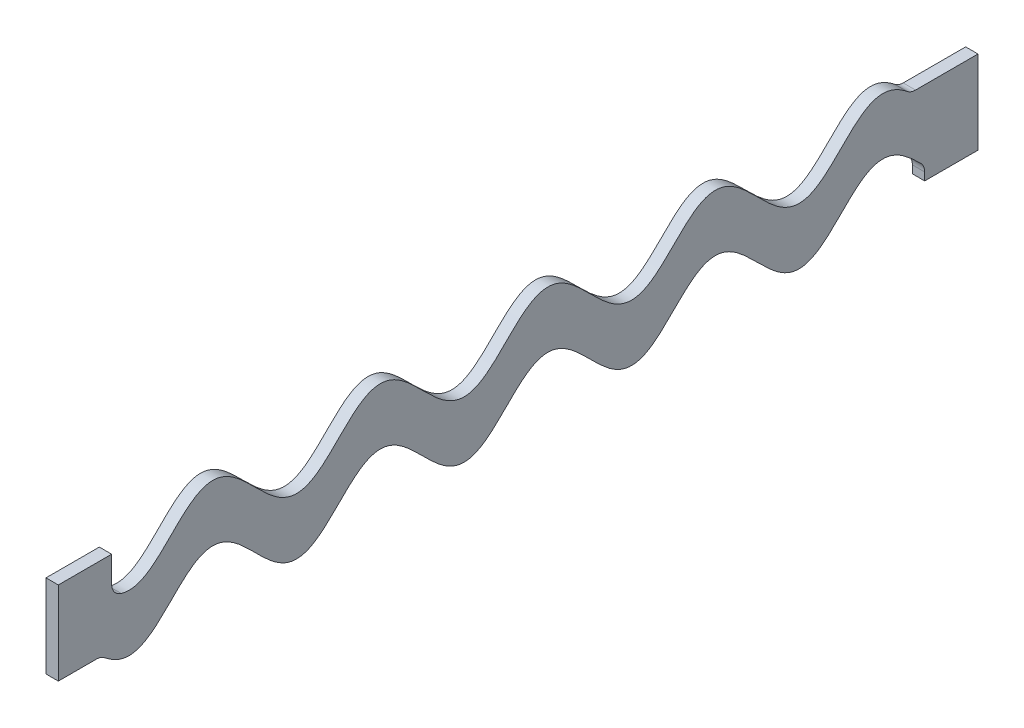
ISO-10303-21;
HEADER;
FILE_DESCRIPTION(('STEP AP214'),'2;1');
FILE_NAME('part.step','',(''),(''),'','','');
FILE_SCHEMA(('AUTOMOTIVE_DESIGN { 1 0 10303 214 1 1 1 1 }'));
ENDSEC;
DATA;
#1=APPLICATION_CONTEXT('core data for automotive mechanical design processes');
#2=APPLICATION_PROTOCOL_DEFINITION('international standard','automotive_design',2000,#1);
#3=PRODUCT_CONTEXT('',#1,'mechanical');
#4=PRODUCT('Part','Part','',(#3));
#5=PRODUCT_RELATED_PRODUCT_CATEGORY('part','',(#4));
#6=PRODUCT_DEFINITION_FORMATION('','',#4);
#7=PRODUCT_DEFINITION_CONTEXT('part definition',#1,'design');
#8=PRODUCT_DEFINITION('design','',#6,#7);
#9=PRODUCT_DEFINITION_SHAPE('','',#8);
#10=(LENGTH_UNIT() NAMED_UNIT(*) SI_UNIT(.MILLI.,.METRE.));
#11=(NAMED_UNIT(*) PLANE_ANGLE_UNIT() SI_UNIT($,.RADIAN.));
#12=(NAMED_UNIT(*) SI_UNIT($,.STERADIAN.) SOLID_ANGLE_UNIT());
#13=UNCERTAINTY_MEASURE_WITH_UNIT(LENGTH_MEASURE(1.E-05),#10,'distance_accuracy_value','');
#14=(GEOMETRIC_REPRESENTATION_CONTEXT(3) GLOBAL_UNCERTAINTY_ASSIGNED_CONTEXT((#13)) GLOBAL_UNIT_ASSIGNED_CONTEXT((#10,
#11,#12)) REPRESENTATION_CONTEXT('',''));
#15=CARTESIAN_POINT('',(0.,0.,0.));
#16=DIRECTION('',(0.,0.,1.));
#17=DIRECTION('',(1.,0.,0.));
#18=AXIS2_PLACEMENT_3D('',#15,#16,#17);
#19=CARTESIAN_POINT('',(882.578272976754,104.775062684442,928.560987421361));
#20=CARTESIAN_POINT('',(882.578272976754,105.60392529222,927.732124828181));
#21=CARTESIAN_POINT('',(882.578272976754,107.264332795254,926.071715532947));
#22=CARTESIAN_POINT('',(882.578272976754,109.373724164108,923.95083061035));
#23=CARTESIAN_POINT('',(882.578272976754,111.092651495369,922.179994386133));
#24=CARTESIAN_POINT('',(882.578272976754,112.456972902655,920.758899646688));
#25=CARTESIAN_POINT('',(882.578272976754,113.266104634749,919.905590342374));
#26=CARTESIAN_POINT('',(882.578272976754,114.446775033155,918.647550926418));
#27=CARTESIAN_POINT('',(882.578272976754,115.886355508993,917.073543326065));
#28=CARTESIAN_POINT('',(882.578272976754,117.680028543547,915.045410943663));
#29=CARTESIAN_POINT('',(882.578272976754,119.566632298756,912.805719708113));
#30=CARTESIAN_POINT('',(882.578272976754,121.533342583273,910.313232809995));
#31=CARTESIAN_POINT('',(882.578272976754,123.521122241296,907.545767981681));
#32=CARTESIAN_POINT('',(882.578272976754,125.468547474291,904.488738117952));
#33=CARTESIAN_POINT('',(882.578272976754,127.282376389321,901.104776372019));
#34=CARTESIAN_POINT('',(882.578272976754,128.73651377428,897.580230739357));
#35=CARTESIAN_POINT('',(882.578272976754,129.730592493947,893.930606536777));
#36=CARTESIAN_POINT('',(882.578272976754,130.31311017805,889.607867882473));
#37=CARTESIAN_POINT('',(882.578272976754,130.143680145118,885.223810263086));
#38=CARTESIAN_POINT('',(882.578272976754,129.113655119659,880.702727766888));
#39=CARTESIAN_POINT('',(882.578272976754,127.051449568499,875.620572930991));
#40=CARTESIAN_POINT('',(882.578272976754,124.322937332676,870.816362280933));
#41=CARTESIAN_POINT('',(882.578272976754,121.000852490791,866.208543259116));
#42=CARTESIAN_POINT('',(882.578272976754,117.253089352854,861.732107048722));
#43=CARTESIAN_POINT('',(882.578272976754,113.618030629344,857.757692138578));
#44=CARTESIAN_POINT('',(882.578272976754,110.193281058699,854.202573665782));
#45=CARTESIAN_POINT('',(882.578272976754,105.846647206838,849.824093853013));
#46=CARTESIAN_POINT('',(882.578272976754,100.594160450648,844.605654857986));
#47=CARTESIAN_POINT('',(882.578272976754,95.077102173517,838.962294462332));
#48=CARTESIAN_POINT('',(882.578272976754,89.5423278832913,832.659802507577));
#49=CARTESIAN_POINT('',(882.578272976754,85.4189076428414,827.011816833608));
#50=CARTESIAN_POINT('',(882.578272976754,82.6209096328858,822.158907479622));
#51=CARTESIAN_POINT('',(882.578272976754,80.5104252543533,817.055642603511));
#52=CARTESIAN_POINT('',(882.578272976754,79.2477285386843,811.736634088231));
#53=CARTESIAN_POINT('',(882.578272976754,79.2204672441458,806.236894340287));
#54=CARTESIAN_POINT('',(882.578272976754,80.437186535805,800.906377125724));
#55=CARTESIAN_POINT('',(882.578272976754,82.4983032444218,795.82400973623));
#56=CARTESIAN_POINT('',(882.578272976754,85.2273331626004,791.020076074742));
#57=CARTESIAN_POINT('',(882.578272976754,89.2720872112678,785.409382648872));
#58=CARTESIAN_POINT('',(882.578272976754,94.7302185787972,779.141205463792));
#59=CARTESIAN_POINT('',(882.578272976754,101.069699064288,772.628892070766));
#60=CARTESIAN_POINT('',(882.578272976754,108.093410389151,765.69210174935));
#61=CARTESIAN_POINT('',(882.578272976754,114.47277224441,759.165106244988));
#62=CARTESIAN_POINT('',(882.578272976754,120.008215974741,752.86445854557));
#63=CARTESIAN_POINT('',(882.578272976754,124.763168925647,746.347060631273));
#64=CARTESIAN_POINT('',(882.578272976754,128.233444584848,739.967501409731));
#65=CARTESIAN_POINT('',(882.578272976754,130.298984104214,733.021139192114));
#66=CARTESIAN_POINT('',(882.578272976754,130.329391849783,726.423393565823));
#67=CARTESIAN_POINT('',(882.578272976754,129.10412327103,721.078126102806));
#68=CARTESIAN_POINT('',(882.578272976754,127.024545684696,715.966949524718));
#69=CARTESIAN_POINT('',(882.578272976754,124.259804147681,711.124401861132));
#70=CARTESIAN_POINT('',(882.578272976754,120.907591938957,706.492404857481));
#71=CARTESIAN_POINT('',(882.578272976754,117.112401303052,701.979614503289));
#72=CARTESIAN_POINT('',(882.578272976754,113.46891035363,698.00567700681));
#73=CARTESIAN_POINT('',(882.578272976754,109.995830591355,694.408989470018));
#74=CARTESIAN_POINT('',(882.578272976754,107.427440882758,691.823964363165));
#75=CARTESIAN_POINT('',(882.578272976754,104.503062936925,688.899719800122));
#76=CARTESIAN_POINT('',(882.578272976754,103.069928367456,687.466142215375));
#77=CARTESIAN_POINT('',(882.578272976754,100.77637228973,685.167016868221));
#78=CARTESIAN_POINT('',(882.578272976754,97.3791755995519,681.70413320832));
#79=CARTESIAN_POINT('',(882.578272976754,93.5006631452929,677.581940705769));
#80=CARTESIAN_POINT('',(882.578272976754,89.121286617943,672.480175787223));
#81=CARTESIAN_POINT('',(882.578272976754,85.141951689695,667.054270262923));
#82=CARTESIAN_POINT('',(882.578272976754,82.0812242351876,661.622370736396));
#83=CARTESIAN_POINT('',(882.578272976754,80.138704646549,656.262670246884));
#84=CARTESIAN_POINT('',(882.578272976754,79.3117228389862,651.435136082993));
#85=CARTESIAN_POINT('',(882.578272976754,79.3172319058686,647.029845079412));
#86=CARTESIAN_POINT('',(882.578272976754,80.1630378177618,642.195392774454));
#87=CARTESIAN_POINT('',(882.578272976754,82.1244015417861,636.830798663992));
#88=CARTESIAN_POINT('',(882.578272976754,86.0020446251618,629.993534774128));
#89=CARTESIAN_POINT('',(882.578272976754,92.191740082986,622.201185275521));
#90=CARTESIAN_POINT('',(882.578272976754,100.177331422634,613.87945729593));
#91=CARTESIAN_POINT('',(882.578272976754,109.372670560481,604.870915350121));
#92=CARTESIAN_POINT('',(882.578272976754,116.709082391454,597.226133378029));
#93=CARTESIAN_POINT('',(882.578272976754,121.958451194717,590.757458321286));
#94=CARTESIAN_POINT('',(882.578272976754,125.607239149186,585.126835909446));
#95=CARTESIAN_POINT('',(882.578272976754,127.748904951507,581.034152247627));
#96=CARTESIAN_POINT('',(882.578272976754,129.387467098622,576.55488235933));
#97=CARTESIAN_POINT('',(882.578272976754,130.232694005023,571.72054231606));
#98=CARTESIAN_POINT('',(882.578272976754,130.238524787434,567.315188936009));
#99=CARTESIAN_POINT('',(882.578272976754,129.411351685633,562.487691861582));
#100=CARTESIAN_POINT('',(882.578272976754,127.468960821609,557.127966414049));
#101=CARTESIAN_POINT('',(882.578272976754,124.408141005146,551.696084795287));
#102=CARTESIAN_POINT('',(882.578272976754,120.428870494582,546.270166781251));
#103=CARTESIAN_POINT('',(882.578272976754,116.049449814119,541.168410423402));
#104=CARTESIAN_POINT('',(882.578272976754,112.170966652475,537.046212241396));
#105=CARTESIAN_POINT('',(882.578272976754,108.773752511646,533.583331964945));
#106=CARTESIAN_POINT('',(882.578272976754,105.918964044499,530.721545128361));
#107=CARTESIAN_POINT('',(882.578272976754,103.631171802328,528.435895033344));
#108=CARTESIAN_POINT('',(882.578272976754,100.776373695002,525.574110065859));
#109=CARTESIAN_POINT('',(882.578272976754,97.3791770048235,522.111226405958));
#110=CARTESIAN_POINT('',(882.578272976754,93.5006645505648,517.989033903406));
#111=CARTESIAN_POINT('',(882.578272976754,89.121288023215,512.88726898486));
#112=CARTESIAN_POINT('',(882.578272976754,85.1419530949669,507.46136346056));
#113=CARTESIAN_POINT('',(882.578272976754,82.0812256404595,502.029463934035));
#114=CARTESIAN_POINT('',(882.578272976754,80.1387060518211,496.669763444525));
#115=CARTESIAN_POINT('',(882.578272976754,79.3117242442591,491.84222928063));
#116=CARTESIAN_POINT('',(882.578272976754,79.3172333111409,487.43693827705));
#117=CARTESIAN_POINT('',(882.578272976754,80.1630392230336,482.60248597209));
#118=CARTESIAN_POINT('',(882.578272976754,82.1244029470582,477.237891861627));
#119=CARTESIAN_POINT('',(882.578272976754,86.0020460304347,470.400627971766));
#120=CARTESIAN_POINT('',(882.578272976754,92.1917414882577,462.608278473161));
#121=CARTESIAN_POINT('',(882.578272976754,100.177332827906,454.28655049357));
#122=CARTESIAN_POINT('',(882.578272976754,109.372671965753,445.278008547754));
#123=CARTESIAN_POINT('',(882.578272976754,116.709083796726,437.633226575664));
#124=CARTESIAN_POINT('',(882.578272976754,121.95845259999,431.164551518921));
#125=CARTESIAN_POINT('',(882.578272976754,125.607240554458,425.533929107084));
#126=CARTESIAN_POINT('',(882.578272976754,127.748906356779,421.441245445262));
#127=CARTESIAN_POINT('',(882.578272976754,129.387468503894,416.961975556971));
#128=CARTESIAN_POINT('',(882.578272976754,130.232695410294,412.127635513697));
#129=CARTESIAN_POINT('',(882.578272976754,130.238526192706,407.722282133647));
#130=CARTESIAN_POINT('',(882.578272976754,129.411353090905,402.894785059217));
#131=CARTESIAN_POINT('',(882.578272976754,127.468962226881,397.535059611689));
#132=CARTESIAN_POINT('',(882.578272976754,124.408142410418,392.103177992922));
#133=CARTESIAN_POINT('',(882.578272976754,120.428871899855,386.677259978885));
#134=CARTESIAN_POINT('',(882.578272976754,116.049451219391,381.575503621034));
#135=CARTESIAN_POINT('',(882.578272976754,112.170968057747,377.453305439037));
#136=CARTESIAN_POINT('',(882.578272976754,108.773753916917,373.990425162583));
#137=CARTESIAN_POINT('',(882.578272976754,105.918965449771,371.128638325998));
#138=CARTESIAN_POINT('',(882.578272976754,103.6311732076,368.842988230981));
#139=CARTESIAN_POINT('',(882.578272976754,100.776375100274,365.981203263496));
#140=CARTESIAN_POINT('',(882.578272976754,97.3791784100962,362.518319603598));
#141=CARTESIAN_POINT('',(882.578272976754,93.5006659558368,358.396127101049));
#142=CARTESIAN_POINT('',(882.578272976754,89.1212894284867,353.294362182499));
#143=CARTESIAN_POINT('',(882.578272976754,85.1419545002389,347.868456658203));
#144=CARTESIAN_POINT('',(882.578272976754,82.0812270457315,342.436557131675));
#145=CARTESIAN_POINT('',(882.578272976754,80.1387074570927,337.076856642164));
#146=CARTESIAN_POINT('',(882.578272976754,79.3117256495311,332.249322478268));
#147=CARTESIAN_POINT('',(882.578272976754,79.3172347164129,327.844031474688));
#148=CARTESIAN_POINT('',(882.578272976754,80.1630406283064,323.009579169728));
#149=CARTESIAN_POINT('',(882.578272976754,82.1244043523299,317.644985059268));
#150=CARTESIAN_POINT('',(882.578272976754,86.0020474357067,310.807721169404));
#151=CARTESIAN_POINT('',(882.578272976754,92.1917428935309,303.015371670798));
#152=CARTESIAN_POINT('',(882.578272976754,100.177334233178,294.693643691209));
#153=CARTESIAN_POINT('',(882.578272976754,109.372673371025,285.685101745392));
#154=CARTESIAN_POINT('',(882.578272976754,116.709085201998,278.040319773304));
#155=CARTESIAN_POINT('',(882.578272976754,121.958454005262,271.571644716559));
#156=CARTESIAN_POINT('',(882.578272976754,125.60724195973,265.941022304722));
#157=CARTESIAN_POINT('',(882.578272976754,127.748907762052,261.848338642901));
#158=CARTESIAN_POINT('',(882.578272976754,129.387469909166,257.36906875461));
#159=CARTESIAN_POINT('',(882.578272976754,130.232696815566,252.534728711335));
#160=CARTESIAN_POINT('',(882.578272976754,130.238527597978,248.129375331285));
#161=CARTESIAN_POINT('',(882.578272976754,129.411354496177,243.301878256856));
#162=CARTESIAN_POINT('',(882.578272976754,127.468963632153,237.942152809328));
#163=CARTESIAN_POINT('',(882.578272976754,124.40814381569,232.510271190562));
#164=CARTESIAN_POINT('',(882.578272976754,120.428873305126,227.084353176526));
#165=CARTESIAN_POINT('',(882.578272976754,116.049452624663,221.982596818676));
#166=CARTESIAN_POINT('',(882.578272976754,112.170969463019,217.860398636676));
#167=CARTESIAN_POINT('',(882.578272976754,108.773755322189,214.397518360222));
#168=CARTESIAN_POINT('',(882.578272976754,106.479409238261,212.097538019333));
#169=CARTESIAN_POINT('',(882.578272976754,104.265888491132,209.883578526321));
#170=CARTESIAN_POINT('',(882.578272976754,101.230691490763,206.848453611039));
#171=CARTESIAN_POINT('',(882.578272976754,97.828676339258,203.407682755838));
#172=CARTESIAN_POINT('',(882.578272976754,93.2667792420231,198.54975115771));
#173=CARTESIAN_POINT('',(882.578272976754,88.9316866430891,193.461330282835));
#174=CARTESIAN_POINT('',(882.578272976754,85.0111319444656,188.063748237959));
#175=CARTESIAN_POINT('',(882.578272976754,82.0444502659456,182.729025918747));
#176=CARTESIAN_POINT('',(882.578272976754,80.1425461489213,177.488188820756));
#177=CARTESIAN_POINT('',(882.578272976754,79.3097629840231,172.669373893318));
#178=CARTESIAN_POINT('',(882.578272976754,79.3144441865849,168.255320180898));
#179=CARTESIAN_POINT('',(882.578272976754,80.1645657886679,163.425465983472));
#180=CARTESIAN_POINT('',(882.578272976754,82.0742115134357,158.190680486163));
#181=CARTESIAN_POINT('',(882.578272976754,85.8668227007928,151.413529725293));
#182=CARTESIAN_POINT('',(882.578272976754,92.0334033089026,143.591417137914));
#183=CARTESIAN_POINT('',(882.578272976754,100.076514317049,135.195677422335));
#184=CARTESIAN_POINT('',(882.578272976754,109.473642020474,125.997244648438));
#185=CARTESIAN_POINT('',(882.578272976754,117.516681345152,117.601440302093));
#186=CARTESIAN_POINT('',(882.578272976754,123.683414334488,109.779465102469));
#187=CARTESIAN_POINT('',(882.578272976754,127.475786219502,103.002098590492));
#188=CARTESIAN_POINT('',(882.578272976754,129.385824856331,97.7676672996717));
#189=CARTESIAN_POINT('',(882.578272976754,130.235262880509,92.9371970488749));
#190=CARTESIAN_POINT('',(882.578272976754,130.241152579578,88.5242313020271));
#191=CARTESIAN_POINT('',(882.578272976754,129.406198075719,83.7034681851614));
#192=CARTESIAN_POINT('',(882.578272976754,127.811126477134,79.30166862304));
#193=CARTESIAN_POINT('',(882.578272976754,125.770952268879,75.3460709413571));
#194=CARTESIAN_POINT('',(882.578272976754,123.530133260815,71.8260015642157));
#195=CARTESIAN_POINT('',(882.578272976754,121.536346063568,69.0530504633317));
#196=CARTESIAN_POINT('',(882.578272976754,119.451736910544,66.4107898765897));
#197=CARTESIAN_POINT('',(882.578272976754,117.32961049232,63.9022164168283));
#198=CARTESIAN_POINT('',(882.578272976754,115.113600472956,61.427049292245));
#199=CARTESIAN_POINT('',(882.578272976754,112.892625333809,59.045730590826));
#200=CARTESIAN_POINT('',(882.578272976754,110.550459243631,56.6165737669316));
#201=CARTESIAN_POINT('',(882.578272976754,108.336036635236,54.365860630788));
#202=CARTESIAN_POINT('',(882.578272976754,106.44580382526,52.4707394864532));
#203=CARTESIAN_POINT('',(882.578272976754,105.330524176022,51.3554537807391));
#204=CARTESIAN_POINT('',(882.578272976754,104.775070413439,50.8000000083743));
#205=B_SPLINE_CURVE_WITH_KNOTS('',4,(#19,#20,#21,#22,#23,#24,#25,#26,#27,#28,#29,#30,#31,#32,
#33,#34,#35,#36,#37,#38,#39,#40,#41,#42,#43,#44,#45,#46,#47,#48,#49,#50,#51,#52,#53,#54,#55,#56,
#57,#58,#59,#60,#61,#62,#63,#64,#65,#66,#67,#68,#69,#70,#71,#72,#73,#74,#75,#76,#77,#78,#79,#80,
#81,#82,#83,#84,#85,#86,#87,#88,#89,#90,#91,#92,#93,#94,#95,#96,#97,#98,#99,#100,#101,#102,#103,
#104,#105,#106,#107,#108,#109,#110,#111,#112,#113,#114,#115,#116,#117,#118,#119,#120,#121,#122,
#123,#124,#125,#126,#127,#128,#129,#130,#131,#132,#133,#134,#135,#136,#137,#138,#139,#140,#141,
#142,#143,#144,#145,#146,#147,#148,#149,#150,#151,#152,#153,#154,#155,#156,#157,#158,#159,#160,
#161,#162,#163,#164,#165,#166,#167,#168,#169,#170,#171,#172,#173,#174,#175,#176,#177,#178,#179,
#180,#181,#182,#183,#184,#185,#186,#187,#188,#189,#190,#191,#192,#193,#194,#195,#196,#197,#198,
#199,#200,#201,#202,#203,#204),.UNSPECIFIED.,.F.,.F.,(5,1,1,1,1,1,1,1,1,1,1,1,1,1,1,1,1,1,1,1,1,
1,1,1,1,1,1,1,1,1,1,1,1,1,1,1,1,1,1,1,1,1,1,1,1,1,1,1,1,1,1,1,1,1,2,1,1,1,1,1,1,1,1,1,1,1,1,1,1,
1,1,1,1,1,1,1,1,1,1,1,1,1,1,1,1,1,1,1,1,1,1,1,1,1,1,1,1,1,1,1,1,1,1,1,1,1,1,1,1,1,1,1,1,1,1,1,1,
1,1,1,1,1,1,1,1,1,1,1,1,1,1,1,1,1,1,1,1,1,1,1,1,1,1,1,1,1,1,2,1,1,1,1,1,1,1,1,1,1,1,1,1,1,1,1,1,
1,1,1,1,1,1,1,1,1,1,1,1,1,1,1,5),(0.00947073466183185,0.0126921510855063,0.0159135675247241,
0.0163162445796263,0.0167189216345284,0.017524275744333,0.0191349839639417,0.0207456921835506,
0.0223564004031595,0.0245875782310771,0.0268187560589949,0.0290499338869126,0.0312811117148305,
0.0340721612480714,0.0368632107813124,0.0390107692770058,0.0411583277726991,0.0454672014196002,
0.0482730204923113,0.0510788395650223,0.0554880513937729,0.0598972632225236,0.0631289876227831,
0.0663607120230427,0.0695924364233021,0.0728241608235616,0.0792876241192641,0.0857510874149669,
0.0902605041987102,0.0947699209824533,0.0975757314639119,0.10038154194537,0.104690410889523,
0.108999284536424,0.111805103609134,0.114610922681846,0.119020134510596,0.123429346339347,
0.129892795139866,0.136356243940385,0.142819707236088,0.14928317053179,0.153792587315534,
0.158302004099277,0.163913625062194,0.168222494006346,0.172545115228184,0.175365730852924,
0.178186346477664,0.182642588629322,0.187098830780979,0.190340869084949,0.193582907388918,
0.196824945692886,0.200066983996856,0.203399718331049,0.206732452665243,0.21339792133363,
0.220063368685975,0.22672881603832,0.234432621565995,0.241098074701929,0.245664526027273,
0.250108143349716,0.254529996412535,0.259168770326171,0.265801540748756,0.273535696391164,
0.286801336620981,0.30006698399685,0.31333263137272,0.326598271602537,0.330465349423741,
0.334332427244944,0.34096519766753,0.345603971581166,0.350025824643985,0.354469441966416,
0.359035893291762,0.3657013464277,0.373405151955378,0.380070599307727,0.386736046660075,
0.393401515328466,0.396734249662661,0.400066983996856,0.403399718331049,0.406732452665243,
0.41339792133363,0.420063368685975,0.426728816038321,0.434432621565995,0.441098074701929,
0.445664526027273,0.450108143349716,0.454529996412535,0.459168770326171,0.465801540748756,
0.473535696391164,0.486801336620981,0.500066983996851,0.51333263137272,0.526598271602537,
0.530465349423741,0.534332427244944,0.54096519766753,0.545603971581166,0.550025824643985,
0.554469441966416,0.559035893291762,0.5657013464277,0.573405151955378,0.580070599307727,
0.586736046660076,0.593401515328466,0.596734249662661,0.600066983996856,0.603399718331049,
0.606732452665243,0.61339792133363,0.620063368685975,0.626728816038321,0.634432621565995,
0.641098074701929,0.645664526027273,0.650108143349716,0.654529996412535,0.659168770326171,
0.665801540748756,0.673535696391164,0.686801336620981,0.700066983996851,0.71333263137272,
0.726598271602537,0.730465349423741,0.734332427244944,0.74096519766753,0.745603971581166,
0.750025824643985,0.754469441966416,0.759035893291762,0.7657013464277,0.773405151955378,
0.780070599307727,0.786736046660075,0.793401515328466,0.796734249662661,0.800066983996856,
0.806543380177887,0.813019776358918,0.819496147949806,0.825972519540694,0.832916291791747,
0.839103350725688,0.843420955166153,0.84773851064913,0.852041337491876,0.85634422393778,
0.862592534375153,0.869514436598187,0.882423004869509,0.895331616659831,0.908240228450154,
0.921148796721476,0.928070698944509,0.934319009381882,0.938621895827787,0.942924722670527,
0.947242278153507,0.951559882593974,0.957746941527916,0.961218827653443,0.964690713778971,
0.967928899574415,0.97116708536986,0.974405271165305,0.977643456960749,0.980881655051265,
0.98411985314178,0.987358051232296,0.990596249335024),.UNSPECIFIED.);
#206=DIRECTION('',(-1.,0.,0.));
#207=VECTOR('',#206,1.);
#208=SURFACE_OF_LINEAR_EXTRUSION('',#205,#207);
#209=CARTESIAN_POINT('',(3.33066907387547E-13,104.775062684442,928.560987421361));
#210=CARTESIAN_POINT('',(3.33066907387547E-13,105.60392529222,927.732124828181));
#211=CARTESIAN_POINT('',(3.33066907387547E-13,107.264332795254,926.071715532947));
#212=CARTESIAN_POINT('',(3.33066907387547E-13,109.373724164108,923.95083061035));
#213=CARTESIAN_POINT('',(3.33066907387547E-13,111.092651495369,922.179994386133));
#214=CARTESIAN_POINT('',(3.33066907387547E-13,112.456972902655,920.758899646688));
#215=CARTESIAN_POINT('',(3.33066907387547E-13,113.266104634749,919.905590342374));
#216=CARTESIAN_POINT('',(3.33066907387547E-13,114.446775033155,918.647550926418));
#217=CARTESIAN_POINT('',(3.33066907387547E-13,115.886355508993,917.073543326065));
#218=CARTESIAN_POINT('',(3.33066907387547E-13,117.680028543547,915.045410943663));
#219=CARTESIAN_POINT('',(3.33066907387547E-13,119.566632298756,912.805719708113));
#220=CARTESIAN_POINT('',(3.33066907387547E-13,121.533342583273,910.313232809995));
#221=CARTESIAN_POINT('',(3.33066907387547E-13,123.521122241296,907.545767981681));
#222=CARTESIAN_POINT('',(3.33066907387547E-13,125.468547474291,904.488738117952));
#223=CARTESIAN_POINT('',(3.33066907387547E-13,127.282376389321,901.104776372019));
#224=CARTESIAN_POINT('',(3.33066907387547E-13,128.73651377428,897.580230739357));
#225=CARTESIAN_POINT('',(3.33066907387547E-13,129.730592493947,893.930606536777));
#226=CARTESIAN_POINT('',(3.33066907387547E-13,130.31311017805,889.607867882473));
#227=CARTESIAN_POINT('',(3.33066907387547E-13,130.143680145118,885.223810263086));
#228=CARTESIAN_POINT('',(3.33066907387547E-13,129.113655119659,880.702727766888));
#229=CARTESIAN_POINT('',(3.33066907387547E-13,127.051449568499,875.620572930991));
#230=CARTESIAN_POINT('',(3.33066907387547E-13,124.322937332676,870.816362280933));
#231=CARTESIAN_POINT('',(3.33066907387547E-13,121.000852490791,866.208543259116));
#232=CARTESIAN_POINT('',(3.33066907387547E-13,117.253089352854,861.732107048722));
#233=CARTESIAN_POINT('',(3.33066907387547E-13,113.618030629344,857.757692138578));
#234=CARTESIAN_POINT('',(3.33066907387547E-13,110.193281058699,854.202573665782));
#235=CARTESIAN_POINT('',(3.33066907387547E-13,105.846647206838,849.824093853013));
#236=CARTESIAN_POINT('',(3.33066907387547E-13,100.594160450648,844.605654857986));
#237=CARTESIAN_POINT('',(3.33066907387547E-13,95.077102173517,838.962294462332));
#238=CARTESIAN_POINT('',(3.33066907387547E-13,89.5423278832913,832.659802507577));
#239=CARTESIAN_POINT('',(3.33066907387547E-13,85.4189076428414,827.011816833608));
#240=CARTESIAN_POINT('',(3.33066907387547E-13,82.6209096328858,822.158907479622));
#241=CARTESIAN_POINT('',(3.33066907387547E-13,80.5104252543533,817.055642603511));
#242=CARTESIAN_POINT('',(3.33066907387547E-13,79.2477285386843,811.736634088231));
#243=CARTESIAN_POINT('',(3.33066907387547E-13,79.2204672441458,806.236894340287));
#244=CARTESIAN_POINT('',(3.33066907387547E-13,80.437186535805,800.906377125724));
#245=CARTESIAN_POINT('',(3.33066907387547E-13,82.4983032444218,795.82400973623));
#246=CARTESIAN_POINT('',(3.33066907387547E-13,85.2273331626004,791.020076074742));
#247=CARTESIAN_POINT('',(3.33066907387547E-13,89.2720872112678,785.409382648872));
#248=CARTESIAN_POINT('',(3.33066907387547E-13,94.7302185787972,779.141205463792));
#249=CARTESIAN_POINT('',(3.33066907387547E-13,101.069699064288,772.628892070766));
#250=CARTESIAN_POINT('',(3.33066907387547E-13,108.093410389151,765.69210174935));
#251=CARTESIAN_POINT('',(3.33066907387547E-13,114.47277224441,759.165106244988));
#252=CARTESIAN_POINT('',(3.33066907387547E-13,120.008215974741,752.86445854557));
#253=CARTESIAN_POINT('',(3.33066907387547E-13,124.763168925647,746.347060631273));
#254=CARTESIAN_POINT('',(3.33066907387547E-13,128.233444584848,739.967501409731));
#255=CARTESIAN_POINT('',(3.33066907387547E-13,130.298984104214,733.021139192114));
#256=CARTESIAN_POINT('',(3.33066907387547E-13,130.329391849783,726.423393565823));
#257=CARTESIAN_POINT('',(3.33066907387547E-13,129.10412327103,721.078126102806));
#258=CARTESIAN_POINT('',(3.33066907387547E-13,127.024545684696,715.966949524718));
#259=CARTESIAN_POINT('',(3.33066907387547E-13,124.259804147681,711.124401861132));
#260=CARTESIAN_POINT('',(3.33066907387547E-13,120.907591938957,706.492404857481));
#261=CARTESIAN_POINT('',(3.33066907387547E-13,117.112401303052,701.979614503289));
#262=CARTESIAN_POINT('',(3.33066907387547E-13,113.46891035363,698.00567700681));
#263=CARTESIAN_POINT('',(3.33066907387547E-13,109.995830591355,694.408989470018));
#264=CARTESIAN_POINT('',(3.33066907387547E-13,107.427440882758,691.823964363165));
#265=CARTESIAN_POINT('',(3.33066907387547E-13,104.503062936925,688.899719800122));
#266=CARTESIAN_POINT('',(3.33066907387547E-13,103.069928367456,687.466142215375));
#267=CARTESIAN_POINT('',(3.33066907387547E-13,100.77637228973,685.167016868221));
#268=CARTESIAN_POINT('',(3.33066907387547E-13,97.3791755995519,681.70413320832));
#269=CARTESIAN_POINT('',(3.33066907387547E-13,93.5006631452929,677.581940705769));
#270=CARTESIAN_POINT('',(3.33066907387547E-13,89.121286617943,672.480175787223));
#271=CARTESIAN_POINT('',(3.33066907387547E-13,85.141951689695,667.054270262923));
#272=CARTESIAN_POINT('',(3.33066907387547E-13,82.0812242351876,661.622370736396));
#273=CARTESIAN_POINT('',(3.33066907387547E-13,80.138704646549,656.262670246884));
#274=CARTESIAN_POINT('',(3.33066907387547E-13,79.3117228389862,651.435136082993));
#275=CARTESIAN_POINT('',(3.33066907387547E-13,79.3172319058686,647.029845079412));
#276=CARTESIAN_POINT('',(3.33066907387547E-13,80.1630378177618,642.195392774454));
#277=CARTESIAN_POINT('',(3.33066907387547E-13,82.1244015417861,636.830798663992));
#278=CARTESIAN_POINT('',(3.33066907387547E-13,86.0020446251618,629.993534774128));
#279=CARTESIAN_POINT('',(3.33066907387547E-13,92.191740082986,622.201185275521));
#280=CARTESIAN_POINT('',(3.33066907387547E-13,100.177331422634,613.87945729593));
#281=CARTESIAN_POINT('',(3.33066907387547E-13,109.372670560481,604.870915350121));
#282=CARTESIAN_POINT('',(3.33066907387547E-13,116.709082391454,597.226133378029));
#283=CARTESIAN_POINT('',(3.33066907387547E-13,121.958451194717,590.757458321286));
#284=CARTESIAN_POINT('',(3.33066907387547E-13,125.607239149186,585.126835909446));
#285=CARTESIAN_POINT('',(3.33066907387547E-13,127.748904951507,581.034152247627));
#286=CARTESIAN_POINT('',(3.33066907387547E-13,129.387467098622,576.55488235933));
#287=CARTESIAN_POINT('',(3.33066907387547E-13,130.232694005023,571.72054231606));
#288=CARTESIAN_POINT('',(3.33066907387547E-13,130.238524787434,567.315188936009));
#289=CARTESIAN_POINT('',(3.33066907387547E-13,129.411351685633,562.487691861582));
#290=CARTESIAN_POINT('',(3.33066907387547E-13,127.468960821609,557.127966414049));
#291=CARTESIAN_POINT('',(3.33066907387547E-13,124.408141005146,551.696084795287));
#292=CARTESIAN_POINT('',(3.33066907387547E-13,120.428870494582,546.270166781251));
#293=CARTESIAN_POINT('',(3.33066907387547E-13,116.049449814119,541.168410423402));
#294=CARTESIAN_POINT('',(3.33066907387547E-13,112.170966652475,537.046212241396));
#295=CARTESIAN_POINT('',(3.33066907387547E-13,108.773752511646,533.583331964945));
#296=CARTESIAN_POINT('',(3.33066907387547E-13,105.918964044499,530.721545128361));
#297=CARTESIAN_POINT('',(3.33066907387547E-13,103.631171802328,528.435895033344));
#298=CARTESIAN_POINT('',(3.33066907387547E-13,100.776373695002,525.574110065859));
#299=CARTESIAN_POINT('',(3.33066907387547E-13,97.3791770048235,522.111226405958));
#300=CARTESIAN_POINT('',(3.33066907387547E-13,93.5006645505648,517.989033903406));
#301=CARTESIAN_POINT('',(3.33066907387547E-13,89.121288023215,512.88726898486));
#302=CARTESIAN_POINT('',(3.33066907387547E-13,85.1419530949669,507.46136346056));
#303=CARTESIAN_POINT('',(3.33066907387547E-13,82.0812256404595,502.029463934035));
#304=CARTESIAN_POINT('',(3.33066907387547E-13,80.1387060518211,496.669763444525));
#305=CARTESIAN_POINT('',(3.33066907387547E-13,79.3117242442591,491.84222928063));
#306=CARTESIAN_POINT('',(3.33066907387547E-13,79.3172333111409,487.43693827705));
#307=CARTESIAN_POINT('',(3.33066907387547E-13,80.1630392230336,482.60248597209));
#308=CARTESIAN_POINT('',(3.33066907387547E-13,82.1244029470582,477.237891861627));
#309=CARTESIAN_POINT('',(3.33066907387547E-13,86.0020460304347,470.400627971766));
#310=CARTESIAN_POINT('',(3.33066907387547E-13,92.1917414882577,462.608278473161));
#311=CARTESIAN_POINT('',(3.33066907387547E-13,100.177332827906,454.28655049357));
#312=CARTESIAN_POINT('',(3.33066907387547E-13,109.372671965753,445.278008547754));
#313=CARTESIAN_POINT('',(3.33066907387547E-13,116.709083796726,437.633226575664));
#314=CARTESIAN_POINT('',(3.33066907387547E-13,121.95845259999,431.164551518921));
#315=CARTESIAN_POINT('',(3.33066907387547E-13,125.607240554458,425.533929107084));
#316=CARTESIAN_POINT('',(3.33066907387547E-13,127.748906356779,421.441245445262));
#317=CARTESIAN_POINT('',(3.33066907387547E-13,129.387468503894,416.961975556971));
#318=CARTESIAN_POINT('',(3.33066907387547E-13,130.232695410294,412.127635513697));
#319=CARTESIAN_POINT('',(3.33066907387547E-13,130.238526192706,407.722282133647));
#320=CARTESIAN_POINT('',(3.33066907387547E-13,129.411353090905,402.894785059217));
#321=CARTESIAN_POINT('',(3.33066907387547E-13,127.468962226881,397.535059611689));
#322=CARTESIAN_POINT('',(3.33066907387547E-13,124.408142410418,392.103177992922));
#323=CARTESIAN_POINT('',(3.33066907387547E-13,120.428871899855,386.677259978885));
#324=CARTESIAN_POINT('',(3.33066907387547E-13,116.049451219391,381.575503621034));
#325=CARTESIAN_POINT('',(3.33066907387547E-13,112.170968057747,377.453305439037));
#326=CARTESIAN_POINT('',(3.33066907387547E-13,108.773753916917,373.990425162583));
#327=CARTESIAN_POINT('',(3.33066907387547E-13,105.918965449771,371.128638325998));
#328=CARTESIAN_POINT('',(3.33066907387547E-13,103.6311732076,368.842988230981));
#329=CARTESIAN_POINT('',(3.33066907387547E-13,100.776375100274,365.981203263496));
#330=CARTESIAN_POINT('',(3.33066907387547E-13,97.3791784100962,362.518319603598));
#331=CARTESIAN_POINT('',(3.33066907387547E-13,93.5006659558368,358.396127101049));
#332=CARTESIAN_POINT('',(3.33066907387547E-13,89.1212894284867,353.294362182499));
#333=CARTESIAN_POINT('',(3.33066907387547E-13,85.1419545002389,347.868456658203));
#334=CARTESIAN_POINT('',(3.33066907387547E-13,82.0812270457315,342.436557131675));
#335=CARTESIAN_POINT('',(3.33066907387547E-13,80.1387074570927,337.076856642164));
#336=CARTESIAN_POINT('',(3.33066907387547E-13,79.3117256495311,332.249322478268));
#337=CARTESIAN_POINT('',(3.33066907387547E-13,79.3172347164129,327.844031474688));
#338=CARTESIAN_POINT('',(3.33066907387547E-13,80.1630406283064,323.009579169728));
#339=CARTESIAN_POINT('',(3.33066907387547E-13,82.1244043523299,317.644985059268));
#340=CARTESIAN_POINT('',(3.33066907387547E-13,86.0020474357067,310.807721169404));
#341=CARTESIAN_POINT('',(3.33066907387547E-13,92.1917428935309,303.015371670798));
#342=CARTESIAN_POINT('',(3.33066907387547E-13,100.177334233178,294.693643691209));
#343=CARTESIAN_POINT('',(3.33066907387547E-13,109.372673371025,285.685101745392));
#344=CARTESIAN_POINT('',(3.33066907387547E-13,116.709085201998,278.040319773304));
#345=CARTESIAN_POINT('',(3.33066907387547E-13,121.958454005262,271.571644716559));
#346=CARTESIAN_POINT('',(3.33066907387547E-13,125.60724195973,265.941022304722));
#347=CARTESIAN_POINT('',(3.33066907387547E-13,127.748907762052,261.848338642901));
#348=CARTESIAN_POINT('',(3.33066907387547E-13,129.387469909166,257.36906875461));
#349=CARTESIAN_POINT('',(3.33066907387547E-13,130.232696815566,252.534728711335));
#350=CARTESIAN_POINT('',(3.33066907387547E-13,130.238527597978,248.129375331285));
#351=CARTESIAN_POINT('',(3.33066907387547E-13,129.411354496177,243.301878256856));
#352=CARTESIAN_POINT('',(3.33066907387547E-13,127.468963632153,237.942152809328));
#353=CARTESIAN_POINT('',(3.33066907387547E-13,124.40814381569,232.510271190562));
#354=CARTESIAN_POINT('',(3.33066907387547E-13,120.428873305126,227.084353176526));
#355=CARTESIAN_POINT('',(3.33066907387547E-13,116.049452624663,221.982596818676));
#356=CARTESIAN_POINT('',(3.33066907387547E-13,112.170969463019,217.860398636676));
#357=CARTESIAN_POINT('',(3.33066907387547E-13,108.773755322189,214.397518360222));
#358=CARTESIAN_POINT('',(3.33066907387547E-13,106.479409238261,212.097538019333));
#359=CARTESIAN_POINT('',(3.33066907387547E-13,104.265888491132,209.883578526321));
#360=CARTESIAN_POINT('',(3.33066907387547E-13,101.230691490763,206.848453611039));
#361=CARTESIAN_POINT('',(3.33066907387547E-13,97.828676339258,203.407682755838));
#362=CARTESIAN_POINT('',(3.33066907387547E-13,93.2667792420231,198.54975115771));
#363=CARTESIAN_POINT('',(3.33066907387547E-13,88.9316866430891,193.461330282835));
#364=CARTESIAN_POINT('',(3.33066907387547E-13,85.0111319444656,188.063748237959));
#365=CARTESIAN_POINT('',(3.33066907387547E-13,82.0444502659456,182.729025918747));
#366=CARTESIAN_POINT('',(3.33066907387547E-13,80.1425461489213,177.488188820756));
#367=CARTESIAN_POINT('',(3.33066907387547E-13,79.3097629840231,172.669373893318));
#368=CARTESIAN_POINT('',(3.33066907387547E-13,79.3144441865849,168.255320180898));
#369=CARTESIAN_POINT('',(3.33066907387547E-13,80.1645657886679,163.425465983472));
#370=CARTESIAN_POINT('',(3.33066907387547E-13,82.0742115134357,158.190680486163));
#371=CARTESIAN_POINT('',(3.33066907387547E-13,85.8668227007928,151.413529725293));
#372=CARTESIAN_POINT('',(3.33066907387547E-13,92.0334033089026,143.591417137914));
#373=CARTESIAN_POINT('',(3.33066907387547E-13,100.076514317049,135.195677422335));
#374=CARTESIAN_POINT('',(3.33066907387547E-13,109.473642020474,125.997244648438));
#375=CARTESIAN_POINT('',(3.33066907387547E-13,117.516681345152,117.601440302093));
#376=CARTESIAN_POINT('',(3.33066907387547E-13,123.683414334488,109.779465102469));
#377=CARTESIAN_POINT('',(3.33066907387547E-13,127.475786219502,103.002098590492));
#378=CARTESIAN_POINT('',(3.33066907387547E-13,129.385824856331,97.7676672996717));
#379=CARTESIAN_POINT('',(3.33066907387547E-13,130.235262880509,92.9371970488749));
#380=CARTESIAN_POINT('',(3.33066907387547E-13,130.241152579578,88.5242313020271));
#381=CARTESIAN_POINT('',(3.33066907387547E-13,129.406198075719,83.7034681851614));
#382=CARTESIAN_POINT('',(3.33066907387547E-13,127.811126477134,79.30166862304));
#383=CARTESIAN_POINT('',(3.33066907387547E-13,125.770952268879,75.3460709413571));
#384=CARTESIAN_POINT('',(3.33066907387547E-13,123.530133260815,71.8260015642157));
#385=CARTESIAN_POINT('',(3.33066907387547E-13,121.536346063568,69.0530504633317));
#386=CARTESIAN_POINT('',(3.33066907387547E-13,119.451736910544,66.4107898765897));
#387=CARTESIAN_POINT('',(3.33066907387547E-13,117.32961049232,63.9022164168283));
#388=CARTESIAN_POINT('',(3.33066907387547E-13,115.113600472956,61.427049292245));
#389=CARTESIAN_POINT('',(3.33066907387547E-13,112.892625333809,59.045730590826));
#390=CARTESIAN_POINT('',(3.33066907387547E-13,110.550459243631,56.6165737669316));
#391=CARTESIAN_POINT('',(3.33066907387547E-13,108.336036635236,54.365860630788));
#392=CARTESIAN_POINT('',(3.33066907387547E-13,106.44580382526,52.4707394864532));
#393=CARTESIAN_POINT('',(3.33066907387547E-13,105.330524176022,51.3554537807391));
#394=CARTESIAN_POINT('',(3.33066907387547E-13,104.775070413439,50.8000000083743));
#395=B_SPLINE_CURVE_WITH_KNOTS('',4,(#209,#210,#211,#212,#213,#214,#215,#216,#217,#218,#219,
#220,#221,#222,#223,#224,#225,#226,#227,#228,#229,#230,#231,#232,#233,#234,#235,#236,#237,#238,
#239,#240,#241,#242,#243,#244,#245,#246,#247,#248,#249,#250,#251,#252,#253,#254,#255,#256,#257,
#258,#259,#260,#261,#262,#263,#264,#265,#266,#267,#268,#269,#270,#271,#272,#273,#274,#275,#276,
#277,#278,#279,#280,#281,#282,#283,#284,#285,#286,#287,#288,#289,#290,#291,#292,#293,#294,#295,
#296,#297,#298,#299,#300,#301,#302,#303,#304,#305,#306,#307,#308,#309,#310,#311,#312,#313,#314,
#315,#316,#317,#318,#319,#320,#321,#322,#323,#324,#325,#326,#327,#328,#329,#330,#331,#332,#333,
#334,#335,#336,#337,#338,#339,#340,#341,#342,#343,#344,#345,#346,#347,#348,#349,#350,#351,#352,
#353,#354,#355,#356,#357,#358,#359,#360,#361,#362,#363,#364,#365,#366,#367,#368,#369,#370,#371,
#372,#373,#374,#375,#376,#377,#378,#379,#380,#381,#382,#383,#384,#385,#386,#387,#388,#389,#390,
#391,#392,#393,#394),.UNSPECIFIED.,.F.,.F.,(5,1,1,1,1,1,1,1,1,1,1,1,1,1,1,1,1,1,1,1,1,1,1,1,1,1,
1,1,1,1,1,1,1,1,1,1,1,1,1,1,1,1,1,1,1,1,1,1,1,1,1,1,1,1,2,1,1,1,1,1,1,1,1,1,1,1,1,1,1,1,1,1,1,1,
1,1,1,1,1,1,1,1,1,1,1,1,1,1,1,1,1,1,1,1,1,1,1,1,1,1,1,1,1,1,1,1,1,1,1,1,1,1,1,1,1,1,1,1,1,1,1,1,
1,1,1,1,1,1,1,1,1,1,1,1,1,1,1,1,1,1,1,1,1,1,1,1,1,2,1,1,1,1,1,1,1,1,1,1,1,1,1,1,1,1,1,1,1,1,1,1,
1,1,1,1,1,1,1,1,1,1,5),(0.00947073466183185,0.0126921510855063,0.0159135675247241,
0.0163162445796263,0.0167189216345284,0.017524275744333,0.0191349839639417,0.0207456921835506,
0.0223564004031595,0.0245875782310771,0.0268187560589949,0.0290499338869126,0.0312811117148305,
0.0340721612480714,0.0368632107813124,0.0390107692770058,0.0411583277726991,0.0454672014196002,
0.0482730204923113,0.0510788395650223,0.0554880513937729,0.0598972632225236,0.0631289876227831,
0.0663607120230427,0.0695924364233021,0.0728241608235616,0.0792876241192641,0.0857510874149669,
0.0902605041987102,0.0947699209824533,0.0975757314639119,0.10038154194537,0.104690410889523,
0.108999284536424,0.111805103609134,0.114610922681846,0.119020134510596,0.123429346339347,
0.129892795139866,0.136356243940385,0.142819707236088,0.14928317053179,0.153792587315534,
0.158302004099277,0.163913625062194,0.168222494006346,0.172545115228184,0.175365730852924,
0.178186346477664,0.182642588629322,0.187098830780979,0.190340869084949,0.193582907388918,
0.196824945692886,0.200066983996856,0.203399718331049,0.206732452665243,0.21339792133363,
0.220063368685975,0.22672881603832,0.234432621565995,0.241098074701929,0.245664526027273,
0.250108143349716,0.254529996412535,0.259168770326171,0.265801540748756,0.273535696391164,
0.286801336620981,0.30006698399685,0.31333263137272,0.326598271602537,0.330465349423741,
0.334332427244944,0.34096519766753,0.345603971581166,0.350025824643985,0.354469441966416,
0.359035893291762,0.3657013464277,0.373405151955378,0.380070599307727,0.386736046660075,
0.393401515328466,0.396734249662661,0.400066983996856,0.403399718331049,0.406732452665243,
0.41339792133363,0.420063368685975,0.426728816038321,0.434432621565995,0.441098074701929,
0.445664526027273,0.450108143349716,0.454529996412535,0.459168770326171,0.465801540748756,
0.473535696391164,0.486801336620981,0.500066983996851,0.51333263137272,0.526598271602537,
0.530465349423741,0.534332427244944,0.54096519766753,0.545603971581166,0.550025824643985,
0.554469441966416,0.559035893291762,0.5657013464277,0.573405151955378,0.580070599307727,
0.586736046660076,0.593401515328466,0.596734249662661,0.600066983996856,0.603399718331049,
0.606732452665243,0.61339792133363,0.620063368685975,0.626728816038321,0.634432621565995,
0.641098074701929,0.645664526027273,0.650108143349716,0.654529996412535,0.659168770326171,
0.665801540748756,0.673535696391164,0.686801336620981,0.700066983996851,0.71333263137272,
0.726598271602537,0.730465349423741,0.734332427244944,0.74096519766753,0.745603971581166,
0.750025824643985,0.754469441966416,0.759035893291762,0.7657013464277,0.773405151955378,
0.780070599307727,0.786736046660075,0.793401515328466,0.796734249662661,0.800066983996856,
0.806543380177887,0.813019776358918,0.819496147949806,0.825972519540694,0.832916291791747,
0.839103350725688,0.843420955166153,0.84773851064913,0.852041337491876,0.85634422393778,
0.862592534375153,0.869514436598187,0.882423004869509,0.895331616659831,0.908240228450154,
0.921148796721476,0.928070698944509,0.934319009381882,0.938621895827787,0.942924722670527,
0.947242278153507,0.951559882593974,0.957746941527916,0.961218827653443,0.964690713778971,
0.967928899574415,0.97116708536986,0.974405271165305,0.977643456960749,0.980881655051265,
0.98411985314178,0.987358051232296,0.990596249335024),.UNSPECIFIED.);
#396=CARTESIAN_POINT('',(3.33066907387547E-13,120.227354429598,67.4115187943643));
#397=VERTEX_POINT('',#396);
#398=CARTESIAN_POINT('',(3.33066907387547E-13,80.4665275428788,816.339248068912));
#399=VERTEX_POINT('',#398);
#400=EDGE_CURVE('E186',#397,#399,#395,.F.);
#401=ORIENTED_EDGE('',*,*,#400,.F.);
#402=DIRECTION('',(-1.,0.,0.));
#403=VECTOR('',#402,1.);
#404=CARTESIAN_POINT('',(3.33066907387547E-13,120.227354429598,67.4115187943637));
#405=LINE('',#404,#403);
#406=CARTESIAN_POINT('',(-11.7399999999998,120.227354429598,67.4115187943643));
#407=VERTEX_POINT('',#406);
#408=EDGE_CURVE('E191',#397,#407,#405,.T.);
#409=ORIENTED_EDGE('',*,*,#408,.T.);
#410=CARTESIAN_POINT('',(-11.7399999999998,104.775062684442,928.560987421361));
#411=CARTESIAN_POINT('',(-11.7399999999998,105.60392529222,927.732124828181));
#412=CARTESIAN_POINT('',(-11.7399999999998,107.264332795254,926.071715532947));
#413=CARTESIAN_POINT('',(-11.7399999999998,109.373724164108,923.95083061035));
#414=CARTESIAN_POINT('',(-11.7399999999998,111.092651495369,922.179994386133));
#415=CARTESIAN_POINT('',(-11.7399999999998,112.456972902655,920.758899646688));
#416=CARTESIAN_POINT('',(-11.7399999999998,113.266104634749,919.905590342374));
#417=CARTESIAN_POINT('',(-11.7399999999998,114.446775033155,918.647550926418));
#418=CARTESIAN_POINT('',(-11.7399999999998,115.886355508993,917.073543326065));
#419=CARTESIAN_POINT('',(-11.7399999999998,117.680028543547,915.045410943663));
#420=CARTESIAN_POINT('',(-11.7399999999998,119.566632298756,912.805719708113));
#421=CARTESIAN_POINT('',(-11.7399999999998,121.533342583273,910.313232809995));
#422=CARTESIAN_POINT('',(-11.7399999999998,123.521122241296,907.545767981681));
#423=CARTESIAN_POINT('',(-11.7399999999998,125.468547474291,904.488738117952));
#424=CARTESIAN_POINT('',(-11.7399999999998,127.282376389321,901.104776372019));
#425=CARTESIAN_POINT('',(-11.7399999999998,128.73651377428,897.580230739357));
#426=CARTESIAN_POINT('',(-11.7399999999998,129.730592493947,893.930606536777));
#427=CARTESIAN_POINT('',(-11.7399999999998,130.31311017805,889.607867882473));
#428=CARTESIAN_POINT('',(-11.7399999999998,130.143680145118,885.223810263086));
#429=CARTESIAN_POINT('',(-11.7399999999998,129.113655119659,880.702727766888));
#430=CARTESIAN_POINT('',(-11.7399999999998,127.051449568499,875.620572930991));
#431=CARTESIAN_POINT('',(-11.7399999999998,124.322937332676,870.816362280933));
#432=CARTESIAN_POINT('',(-11.7399999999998,121.000852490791,866.208543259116));
#433=CARTESIAN_POINT('',(-11.7399999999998,117.253089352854,861.732107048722));
#434=CARTESIAN_POINT('',(-11.7399999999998,113.618030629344,857.757692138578));
#435=CARTESIAN_POINT('',(-11.7399999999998,110.193281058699,854.202573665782));
#436=CARTESIAN_POINT('',(-11.7399999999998,105.846647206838,849.824093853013));
#437=CARTESIAN_POINT('',(-11.7399999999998,100.594160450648,844.605654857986));
#438=CARTESIAN_POINT('',(-11.7399999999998,95.077102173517,838.962294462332));
#439=CARTESIAN_POINT('',(-11.7399999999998,89.5423278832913,832.659802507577));
#440=CARTESIAN_POINT('',(-11.7399999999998,85.4189076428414,827.011816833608));
#441=CARTESIAN_POINT('',(-11.7399999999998,82.6209096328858,822.158907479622));
#442=CARTESIAN_POINT('',(-11.7399999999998,80.5104252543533,817.055642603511));
#443=CARTESIAN_POINT('',(-11.7399999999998,79.2477285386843,811.736634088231));
#444=CARTESIAN_POINT('',(-11.7399999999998,79.2204672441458,806.236894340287));
#445=CARTESIAN_POINT('',(-11.7399999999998,80.437186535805,800.906377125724));
#446=CARTESIAN_POINT('',(-11.7399999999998,82.4983032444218,795.82400973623));
#447=CARTESIAN_POINT('',(-11.7399999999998,85.2273331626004,791.020076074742));
#448=CARTESIAN_POINT('',(-11.7399999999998,89.2720872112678,785.409382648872));
#449=CARTESIAN_POINT('',(-11.7399999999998,94.7302185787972,779.141205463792));
#450=CARTESIAN_POINT('',(-11.7399999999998,101.069699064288,772.628892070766));
#451=CARTESIAN_POINT('',(-11.7399999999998,108.093410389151,765.69210174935));
#452=CARTESIAN_POINT('',(-11.7399999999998,114.47277224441,759.165106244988));
#453=CARTESIAN_POINT('',(-11.7399999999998,120.008215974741,752.86445854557));
#454=CARTESIAN_POINT('',(-11.7399999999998,124.763168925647,746.347060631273));
#455=CARTESIAN_POINT('',(-11.7399999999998,128.233444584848,739.967501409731));
#456=CARTESIAN_POINT('',(-11.7399999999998,130.298984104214,733.021139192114));
#457=CARTESIAN_POINT('',(-11.7399999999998,130.329391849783,726.423393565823));
#458=CARTESIAN_POINT('',(-11.7399999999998,129.10412327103,721.078126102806));
#459=CARTESIAN_POINT('',(-11.7399999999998,127.024545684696,715.966949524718));
#460=CARTESIAN_POINT('',(-11.7399999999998,124.259804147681,711.124401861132));
#461=CARTESIAN_POINT('',(-11.7399999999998,120.907591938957,706.492404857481));
#462=CARTESIAN_POINT('',(-11.7399999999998,117.112401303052,701.979614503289));
#463=CARTESIAN_POINT('',(-11.7399999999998,113.46891035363,698.00567700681));
#464=CARTESIAN_POINT('',(-11.7399999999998,109.995830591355,694.408989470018));
#465=CARTESIAN_POINT('',(-11.7399999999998,107.427440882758,691.823964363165));
#466=CARTESIAN_POINT('',(-11.7399999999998,104.503062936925,688.899719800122));
#467=CARTESIAN_POINT('',(-11.7399999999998,103.069928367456,687.466142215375));
#468=CARTESIAN_POINT('',(-11.7399999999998,100.77637228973,685.167016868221));
#469=CARTESIAN_POINT('',(-11.7399999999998,97.3791755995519,681.70413320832));
#470=CARTESIAN_POINT('',(-11.7399999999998,93.5006631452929,677.581940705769));
#471=CARTESIAN_POINT('',(-11.7399999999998,89.121286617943,672.480175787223));
#472=CARTESIAN_POINT('',(-11.7399999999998,85.141951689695,667.054270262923));
#473=CARTESIAN_POINT('',(-11.7399999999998,82.0812242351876,661.622370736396));
#474=CARTESIAN_POINT('',(-11.7399999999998,80.138704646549,656.262670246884));
#475=CARTESIAN_POINT('',(-11.7399999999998,79.3117228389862,651.435136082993));
#476=CARTESIAN_POINT('',(-11.7399999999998,79.3172319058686,647.029845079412));
#477=CARTESIAN_POINT('',(-11.7399999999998,80.1630378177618,642.195392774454));
#478=CARTESIAN_POINT('',(-11.7399999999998,82.1244015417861,636.830798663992));
#479=CARTESIAN_POINT('',(-11.7399999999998,86.0020446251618,629.993534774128));
#480=CARTESIAN_POINT('',(-11.7399999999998,92.191740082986,622.201185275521));
#481=CARTESIAN_POINT('',(-11.7399999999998,100.177331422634,613.87945729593));
#482=CARTESIAN_POINT('',(-11.7399999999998,109.372670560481,604.870915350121));
#483=CARTESIAN_POINT('',(-11.7399999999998,116.709082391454,597.226133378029));
#484=CARTESIAN_POINT('',(-11.7399999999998,121.958451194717,590.757458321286));
#485=CARTESIAN_POINT('',(-11.7399999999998,125.607239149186,585.126835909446));
#486=CARTESIAN_POINT('',(-11.7399999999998,127.748904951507,581.034152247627));
#487=CARTESIAN_POINT('',(-11.7399999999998,129.387467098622,576.55488235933));
#488=CARTESIAN_POINT('',(-11.7399999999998,130.232694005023,571.72054231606));
#489=CARTESIAN_POINT('',(-11.7399999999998,130.238524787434,567.315188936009));
#490=CARTESIAN_POINT('',(-11.7399999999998,129.411351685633,562.487691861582));
#491=CARTESIAN_POINT('',(-11.7399999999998,127.468960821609,557.127966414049));
#492=CARTESIAN_POINT('',(-11.7399999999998,124.408141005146,551.696084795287));
#493=CARTESIAN_POINT('',(-11.7399999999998,120.428870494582,546.270166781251));
#494=CARTESIAN_POINT('',(-11.7399999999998,116.049449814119,541.168410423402));
#495=CARTESIAN_POINT('',(-11.7399999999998,112.170966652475,537.046212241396));
#496=CARTESIAN_POINT('',(-11.7399999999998,108.773752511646,533.583331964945));
#497=CARTESIAN_POINT('',(-11.7399999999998,105.918964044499,530.721545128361));
#498=CARTESIAN_POINT('',(-11.7399999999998,103.631171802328,528.435895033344));
#499=CARTESIAN_POINT('',(-11.7399999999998,100.776373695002,525.574110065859));
#500=CARTESIAN_POINT('',(-11.7399999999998,97.3791770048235,522.111226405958));
#501=CARTESIAN_POINT('',(-11.7399999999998,93.5006645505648,517.989033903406));
#502=CARTESIAN_POINT('',(-11.7399999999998,89.121288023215,512.88726898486));
#503=CARTESIAN_POINT('',(-11.7399999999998,85.1419530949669,507.46136346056));
#504=CARTESIAN_POINT('',(-11.7399999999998,82.0812256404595,502.029463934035));
#505=CARTESIAN_POINT('',(-11.7399999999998,80.1387060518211,496.669763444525));
#506=CARTESIAN_POINT('',(-11.7399999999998,79.3117242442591,491.84222928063));
#507=CARTESIAN_POINT('',(-11.7399999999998,79.3172333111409,487.43693827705));
#508=CARTESIAN_POINT('',(-11.7399999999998,80.1630392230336,482.60248597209));
#509=CARTESIAN_POINT('',(-11.7399999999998,82.1244029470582,477.237891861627));
#510=CARTESIAN_POINT('',(-11.7399999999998,86.0020460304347,470.400627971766));
#511=CARTESIAN_POINT('',(-11.7399999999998,92.1917414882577,462.608278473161));
#512=CARTESIAN_POINT('',(-11.7399999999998,100.177332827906,454.28655049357));
#513=CARTESIAN_POINT('',(-11.7399999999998,109.372671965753,445.278008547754));
#514=CARTESIAN_POINT('',(-11.7399999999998,116.709083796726,437.633226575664));
#515=CARTESIAN_POINT('',(-11.7399999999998,121.95845259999,431.164551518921));
#516=CARTESIAN_POINT('',(-11.7399999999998,125.607240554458,425.533929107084));
#517=CARTESIAN_POINT('',(-11.7399999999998,127.748906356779,421.441245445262));
#518=CARTESIAN_POINT('',(-11.7399999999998,129.387468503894,416.961975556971));
#519=CARTESIAN_POINT('',(-11.7399999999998,130.232695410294,412.127635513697));
#520=CARTESIAN_POINT('',(-11.7399999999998,130.238526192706,407.722282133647));
#521=CARTESIAN_POINT('',(-11.7399999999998,129.411353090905,402.894785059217));
#522=CARTESIAN_POINT('',(-11.7399999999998,127.468962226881,397.535059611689));
#523=CARTESIAN_POINT('',(-11.7399999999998,124.408142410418,392.103177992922));
#524=CARTESIAN_POINT('',(-11.7399999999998,120.428871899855,386.677259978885));
#525=CARTESIAN_POINT('',(-11.7399999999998,116.049451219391,381.575503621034));
#526=CARTESIAN_POINT('',(-11.7399999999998,112.170968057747,377.453305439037));
#527=CARTESIAN_POINT('',(-11.7399999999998,108.773753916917,373.990425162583));
#528=CARTESIAN_POINT('',(-11.7399999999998,105.918965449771,371.128638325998));
#529=CARTESIAN_POINT('',(-11.7399999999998,103.6311732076,368.842988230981));
#530=CARTESIAN_POINT('',(-11.7399999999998,100.776375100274,365.981203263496));
#531=CARTESIAN_POINT('',(-11.7399999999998,97.3791784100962,362.518319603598));
#532=CARTESIAN_POINT('',(-11.7399999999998,93.5006659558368,358.396127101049));
#533=CARTESIAN_POINT('',(-11.7399999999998,89.1212894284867,353.294362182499));
#534=CARTESIAN_POINT('',(-11.7399999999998,85.1419545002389,347.868456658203));
#535=CARTESIAN_POINT('',(-11.7399999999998,82.0812270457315,342.436557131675));
#536=CARTESIAN_POINT('',(-11.7399999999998,80.1387074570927,337.076856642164));
#537=CARTESIAN_POINT('',(-11.7399999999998,79.3117256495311,332.249322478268));
#538=CARTESIAN_POINT('',(-11.7399999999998,79.3172347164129,327.844031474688));
#539=CARTESIAN_POINT('',(-11.7399999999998,80.1630406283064,323.009579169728));
#540=CARTESIAN_POINT('',(-11.7399999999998,82.1244043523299,317.644985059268));
#541=CARTESIAN_POINT('',(-11.7399999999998,86.0020474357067,310.807721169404));
#542=CARTESIAN_POINT('',(-11.7399999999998,92.1917428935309,303.015371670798));
#543=CARTESIAN_POINT('',(-11.7399999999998,100.177334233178,294.693643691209));
#544=CARTESIAN_POINT('',(-11.7399999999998,109.372673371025,285.685101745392));
#545=CARTESIAN_POINT('',(-11.7399999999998,116.709085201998,278.040319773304));
#546=CARTESIAN_POINT('',(-11.7399999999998,121.958454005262,271.571644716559));
#547=CARTESIAN_POINT('',(-11.7399999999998,125.60724195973,265.941022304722));
#548=CARTESIAN_POINT('',(-11.7399999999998,127.748907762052,261.848338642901));
#549=CARTESIAN_POINT('',(-11.7399999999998,129.387469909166,257.36906875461));
#550=CARTESIAN_POINT('',(-11.7399999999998,130.232696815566,252.534728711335));
#551=CARTESIAN_POINT('',(-11.7399999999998,130.238527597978,248.129375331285));
#552=CARTESIAN_POINT('',(-11.7399999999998,129.411354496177,243.301878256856));
#553=CARTESIAN_POINT('',(-11.7399999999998,127.468963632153,237.942152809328));
#554=CARTESIAN_POINT('',(-11.7399999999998,124.40814381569,232.510271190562));
#555=CARTESIAN_POINT('',(-11.7399999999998,120.428873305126,227.084353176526));
#556=CARTESIAN_POINT('',(-11.7399999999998,116.049452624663,221.982596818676));
#557=CARTESIAN_POINT('',(-11.7399999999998,112.170969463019,217.860398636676));
#558=CARTESIAN_POINT('',(-11.7399999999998,108.773755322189,214.397518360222));
#559=CARTESIAN_POINT('',(-11.7399999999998,106.479409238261,212.097538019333));
#560=CARTESIAN_POINT('',(-11.7399999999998,104.265888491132,209.883578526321));
#561=CARTESIAN_POINT('',(-11.7399999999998,101.230691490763,206.848453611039));
#562=CARTESIAN_POINT('',(-11.7399999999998,97.828676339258,203.407682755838));
#563=CARTESIAN_POINT('',(-11.7399999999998,93.2667792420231,198.54975115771));
#564=CARTESIAN_POINT('',(-11.7399999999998,88.9316866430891,193.461330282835));
#565=CARTESIAN_POINT('',(-11.7399999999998,85.0111319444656,188.063748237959));
#566=CARTESIAN_POINT('',(-11.7399999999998,82.0444502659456,182.729025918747));
#567=CARTESIAN_POINT('',(-11.7399999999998,80.1425461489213,177.488188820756));
#568=CARTESIAN_POINT('',(-11.7399999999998,79.3097629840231,172.669373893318));
#569=CARTESIAN_POINT('',(-11.7399999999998,79.3144441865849,168.255320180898));
#570=CARTESIAN_POINT('',(-11.7399999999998,80.1645657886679,163.425465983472));
#571=CARTESIAN_POINT('',(-11.7399999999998,82.0742115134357,158.190680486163));
#572=CARTESIAN_POINT('',(-11.7399999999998,85.8668227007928,151.413529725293));
#573=CARTESIAN_POINT('',(-11.7399999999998,92.0334033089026,143.591417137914));
#574=CARTESIAN_POINT('',(-11.7399999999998,100.076514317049,135.195677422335));
#575=CARTESIAN_POINT('',(-11.7399999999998,109.473642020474,125.997244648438));
#576=CARTESIAN_POINT('',(-11.7399999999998,117.516681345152,117.601440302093));
#577=CARTESIAN_POINT('',(-11.7399999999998,123.683414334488,109.779465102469));
#578=CARTESIAN_POINT('',(-11.7399999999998,127.475786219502,103.002098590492));
#579=CARTESIAN_POINT('',(-11.7399999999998,129.385824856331,97.7676672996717));
#580=CARTESIAN_POINT('',(-11.7399999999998,130.235262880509,92.9371970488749));
#581=CARTESIAN_POINT('',(-11.7399999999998,130.241152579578,88.5242313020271));
#582=CARTESIAN_POINT('',(-11.7399999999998,129.406198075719,83.7034681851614));
#583=CARTESIAN_POINT('',(-11.7399999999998,127.811126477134,79.30166862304));
#584=CARTESIAN_POINT('',(-11.7399999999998,125.770952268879,75.3460709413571));
#585=CARTESIAN_POINT('',(-11.7399999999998,123.530133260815,71.8260015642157));
#586=CARTESIAN_POINT('',(-11.7399999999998,121.536346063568,69.0530504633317));
#587=CARTESIAN_POINT('',(-11.7399999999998,119.451736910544,66.4107898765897));
#588=CARTESIAN_POINT('',(-11.7399999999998,117.32961049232,63.9022164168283));
#589=CARTESIAN_POINT('',(-11.7399999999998,115.113600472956,61.427049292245));
#590=CARTESIAN_POINT('',(-11.7399999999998,112.892625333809,59.045730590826));
#591=CARTESIAN_POINT('',(-11.7399999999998,110.550459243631,56.6165737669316));
#592=CARTESIAN_POINT('',(-11.7399999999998,108.336036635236,54.365860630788));
#593=CARTESIAN_POINT('',(-11.7399999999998,106.44580382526,52.4707394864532));
#594=CARTESIAN_POINT('',(-11.7399999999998,105.330524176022,51.3554537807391));
#595=CARTESIAN_POINT('',(-11.7399999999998,104.775070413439,50.8000000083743));
#596=B_SPLINE_CURVE_WITH_KNOTS('',4,(#410,#411,#412,#413,#414,#415,#416,#417,#418,#419,#420,
#421,#422,#423,#424,#425,#426,#427,#428,#429,#430,#431,#432,#433,#434,#435,#436,#437,#438,#439,
#440,#441,#442,#443,#444,#445,#446,#447,#448,#449,#450,#451,#452,#453,#454,#455,#456,#457,#458,
#459,#460,#461,#462,#463,#464,#465,#466,#467,#468,#469,#470,#471,#472,#473,#474,#475,#476,#477,
#478,#479,#480,#481,#482,#483,#484,#485,#486,#487,#488,#489,#490,#491,#492,#493,#494,#495,#496,
#497,#498,#499,#500,#501,#502,#503,#504,#505,#506,#507,#508,#509,#510,#511,#512,#513,#514,#515,
#516,#517,#518,#519,#520,#521,#522,#523,#524,#525,#526,#527,#528,#529,#530,#531,#532,#533,#534,
#535,#536,#537,#538,#539,#540,#541,#542,#543,#544,#545,#546,#547,#548,#549,#550,#551,#552,#553,
#554,#555,#556,#557,#558,#559,#560,#561,#562,#563,#564,#565,#566,#567,#568,#569,#570,#571,#572,
#573,#574,#575,#576,#577,#578,#579,#580,#581,#582,#583,#584,#585,#586,#587,#588,#589,#590,#591,
#592,#593,#594,#595),.UNSPECIFIED.,.F.,.F.,(5,1,1,1,1,1,1,1,1,1,1,1,1,1,1,1,1,1,1,1,1,1,1,1,1,1,
1,1,1,1,1,1,1,1,1,1,1,1,1,1,1,1,1,1,1,1,1,1,1,1,1,1,1,1,2,1,1,1,1,1,1,1,1,1,1,1,1,1,1,1,1,1,1,1,
1,1,1,1,1,1,1,1,1,1,1,1,1,1,1,1,1,1,1,1,1,1,1,1,1,1,1,1,1,1,1,1,1,1,1,1,1,1,1,1,1,1,1,1,1,1,1,1,
1,1,1,1,1,1,1,1,1,1,1,1,1,1,1,1,1,1,1,1,1,1,1,1,1,2,1,1,1,1,1,1,1,1,1,1,1,1,1,1,1,1,1,1,1,1,1,1,
1,1,1,1,1,1,1,1,1,1,5),(0.00947073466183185,0.0126921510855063,0.0159135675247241,
0.0163162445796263,0.0167189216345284,0.017524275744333,0.0191349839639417,0.0207456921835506,
0.0223564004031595,0.0245875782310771,0.0268187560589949,0.0290499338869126,0.0312811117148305,
0.0340721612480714,0.0368632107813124,0.0390107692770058,0.0411583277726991,0.0454672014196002,
0.0482730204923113,0.0510788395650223,0.0554880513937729,0.0598972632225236,0.0631289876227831,
0.0663607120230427,0.0695924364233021,0.0728241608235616,0.0792876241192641,0.0857510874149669,
0.0902605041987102,0.0947699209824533,0.0975757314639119,0.10038154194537,0.104690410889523,
0.108999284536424,0.111805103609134,0.114610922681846,0.119020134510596,0.123429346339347,
0.129892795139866,0.136356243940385,0.142819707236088,0.14928317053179,0.153792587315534,
0.158302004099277,0.163913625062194,0.168222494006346,0.172545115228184,0.175365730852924,
0.178186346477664,0.182642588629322,0.187098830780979,0.190340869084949,0.193582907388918,
0.196824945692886,0.200066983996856,0.203399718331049,0.206732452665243,0.21339792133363,
0.220063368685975,0.22672881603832,0.234432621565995,0.241098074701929,0.245664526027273,
0.250108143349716,0.254529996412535,0.259168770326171,0.265801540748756,0.273535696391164,
0.286801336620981,0.30006698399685,0.31333263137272,0.326598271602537,0.330465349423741,
0.334332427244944,0.34096519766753,0.345603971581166,0.350025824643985,0.354469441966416,
0.359035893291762,0.3657013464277,0.373405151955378,0.380070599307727,0.386736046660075,
0.393401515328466,0.396734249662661,0.400066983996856,0.403399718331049,0.406732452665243,
0.41339792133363,0.420063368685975,0.426728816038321,0.434432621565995,0.441098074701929,
0.445664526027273,0.450108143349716,0.454529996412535,0.459168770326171,0.465801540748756,
0.473535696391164,0.486801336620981,0.500066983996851,0.51333263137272,0.526598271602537,
0.530465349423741,0.534332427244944,0.54096519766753,0.545603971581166,0.550025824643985,
0.554469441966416,0.559035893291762,0.5657013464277,0.573405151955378,0.580070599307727,
0.586736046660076,0.593401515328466,0.596734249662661,0.600066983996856,0.603399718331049,
0.606732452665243,0.61339792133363,0.620063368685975,0.626728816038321,0.634432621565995,
0.641098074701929,0.645664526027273,0.650108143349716,0.654529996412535,0.659168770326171,
0.665801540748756,0.673535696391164,0.686801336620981,0.700066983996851,0.71333263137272,
0.726598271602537,0.730465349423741,0.734332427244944,0.74096519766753,0.745603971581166,
0.750025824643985,0.754469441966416,0.759035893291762,0.7657013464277,0.773405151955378,
0.780070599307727,0.786736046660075,0.793401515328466,0.796734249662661,0.800066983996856,
0.806543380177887,0.813019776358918,0.819496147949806,0.825972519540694,0.832916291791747,
0.839103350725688,0.843420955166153,0.84773851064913,0.852041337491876,0.85634422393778,
0.862592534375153,0.869514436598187,0.882423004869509,0.895331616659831,0.908240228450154,
0.921148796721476,0.928070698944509,0.934319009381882,0.938621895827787,0.942924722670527,
0.947242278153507,0.951559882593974,0.957746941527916,0.961218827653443,0.964690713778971,
0.967928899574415,0.97116708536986,0.974405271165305,0.977643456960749,0.980881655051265,
0.98411985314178,0.987358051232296,0.990596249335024),.UNSPECIFIED.);
#597=CARTESIAN_POINT('',(-11.7399999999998,80.4665275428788,816.339248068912));
#598=VERTEX_POINT('',#597);
#599=EDGE_CURVE('E160',#598,#407,#596,.T.);
#600=ORIENTED_EDGE('',*,*,#599,.F.);
#601=DIRECTION('',(-1.,0.,0.));
#602=VECTOR('',#601,1.);
#603=CARTESIAN_POINT('',(-11.74,80.4665275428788,816.339248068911));
#604=LINE('',#603,#602);
#605=EDGE_CURVE('E189',#598,#399,#604,.F.);
#606=ORIENTED_EDGE('',*,*,#605,.T.);
#607=EDGE_LOOP('',(#401,#409,#600,#606));
#608=FACE_BOUND('',#607,.T.);
#609=ADVANCED_FACE('F39',(#608),#208,.T.);
#610=CARTESIAN_POINT('',(2.22044604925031E-13,38.0999999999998,50.8));
#611=DIRECTION('',(-1.,0.,0.));
#612=DIRECTION('',(0.,0.,1.));
#613=AXIS2_PLACEMENT_3D('',#610,#611,#612);
#614=PLANE('',#613);
#615=DIRECTION('',(0.,0.,-1.));
#616=VECTOR('',#615,1.);
#617=CARTESIAN_POINT('',(2.22044604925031E-13,117.475,50.8));
#618=LINE('',#617,#616);
#619=CARTESIAN_POINT('',(2.22044604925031E-13,117.475,59.5163083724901));
#620=VERTEX_POINT('',#619);
#621=CARTESIAN_POINT('',(2.22044604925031E-13,117.475,0.));
#622=VERTEX_POINT('',#621);
#623=EDGE_CURVE('E446',#620,#622,#618,.T.);
#624=ORIENTED_EDGE('',*,*,#623,.F.);
#625=CARTESIAN_POINT('',(2.22044604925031E-13,130.175,59.5163083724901));
#626=DIRECTION('',(-1.,0.,0.));
#627=DIRECTION('',(0.,0.,1.));
#628=AXIS2_PLACEMENT_3D('',#625,#626,#627);
#629=CIRCLE('',#628,12.7);
#630=EDGE_CURVE('E202',#620,#397,#629,.T.);
#631=ORIENTED_EDGE('',*,*,#630,.T.);
#632=ORIENTED_EDGE('',*,*,#400,.T.);
#633=CARTESIAN_POINT('',(2.22044604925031E-13,92.663401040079,812.799999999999));
#634=DIRECTION('',(-1.,0.,0.));
#635=DIRECTION('',(0.,0.,1.));
#636=AXIS2_PLACEMENT_3D('',#633,#634,#635);
#637=CIRCLE('',#636,12.7);
#638=CARTESIAN_POINT('',(2.22044604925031E-13,92.6634010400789,825.5));
#639=VERTEX_POINT('',#638);
#640=EDGE_CURVE('E11',#399,#639,#637,.T.);
#641=ORIENTED_EDGE('',*,*,#640,.T.);
#642=DIRECTION('',(0.,1.,0.));
#643=VECTOR('',#642,1.);
#644=CARTESIAN_POINT('',(2.22044604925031E-13,117.475,825.5));
#645=LINE('',#644,#643);
#646=CARTESIAN_POINT('',(2.22044604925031E-13,117.475,825.5));
#647=VERTEX_POINT('',#646);
#648=EDGE_CURVE('E218',#639,#647,#645,.T.);
#649=ORIENTED_EDGE('',*,*,#648,.T.);
#650=DIRECTION('',(0.,0.,1.));
#651=VECTOR('',#650,1.);
#652=CARTESIAN_POINT('',(2.22044604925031E-13,117.475,876.3));
#653=LINE('',#652,#651);
#654=CARTESIAN_POINT('',(2.22044604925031E-13,117.475,876.3));
#655=VERTEX_POINT('',#654);
#656=EDGE_CURVE('E220',#647,#655,#653,.T.);
#657=ORIENTED_EDGE('',*,*,#656,.T.);
#658=DIRECTION('',(0.,-1.,0.));
#659=VECTOR('',#658,1.);
#660=CARTESIAN_POINT('',(2.22044604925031E-13,117.475,876.3));
#661=LINE('',#660,#659);
#662=CARTESIAN_POINT('',(2.22044604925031E-13,38.0999999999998,876.3));
#663=VERTEX_POINT('',#662);
#664=EDGE_CURVE('E223',#655,#663,#661,.T.);
#665=ORIENTED_EDGE('',*,*,#664,.T.);
#666=DIRECTION('',(0.,0.,-1.));
#667=VECTOR('',#666,1.);
#668=CARTESIAN_POINT('',(2.22044604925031E-13,38.0999999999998,876.3));
#669=LINE('',#668,#667);
#670=CARTESIAN_POINT('',(2.22044604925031E-13,38.0999999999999,840.048741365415));
#671=VERTEX_POINT('',#670);
#672=EDGE_CURVE('E156',#663,#671,#669,.T.);
#673=ORIENTED_EDGE('',*,*,#672,.T.);
#674=CARTESIAN_POINT('',(2.22044604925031E-13,25.400000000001,840.048741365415));
#675=DIRECTION('',(-1.,0.,0.));
#676=DIRECTION('',(0.,0.,1.));
#677=AXIS2_PLACEMENT_3D('',#674,#675,#676);
#678=CIRCLE('',#677,12.7);
#679=CARTESIAN_POINT('',(3.33066907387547E-13,35.3477345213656,832.15364301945));
#680=VERTEX_POINT('',#679);
#681=EDGE_CURVE('E200',#671,#680,#678,.T.);
#682=ORIENTED_EDGE('',*,*,#681,.T.);
#683=CARTESIAN_POINT('',(3.33066907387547E-13,50.7996577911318,50.80000003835));
#684=CARTESIAN_POINT('',(3.33066907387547E-13,51.3551115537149,51.3554538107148));
#685=CARTESIAN_POINT('',(3.33066907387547E-13,52.4703912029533,52.4707395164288));
#686=CARTESIAN_POINT('',(3.33066907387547E-13,54.3606240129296,54.3658606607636));
#687=CARTESIAN_POINT('',(3.33066907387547E-13,56.5750466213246,56.616573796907));
#688=CARTESIAN_POINT('',(3.33066907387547E-13,58.917212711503,59.0457306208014));
#689=CARTESIAN_POINT('',(3.33066907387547E-13,61.1381878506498,61.4270493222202));
#690=CARTESIAN_POINT('',(3.33066907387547E-13,63.3541978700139,63.9022164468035));
#691=CARTESIAN_POINT('',(3.33066907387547E-13,65.4763242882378,66.4107899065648));
#692=CARTESIAN_POINT('',(3.33066907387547E-13,67.5609334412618,69.0530504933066));
#693=CARTESIAN_POINT('',(3.33066907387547E-13,69.5547206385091,71.8260015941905));
#694=CARTESIAN_POINT('',(3.33066907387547E-13,71.7955396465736,75.3460709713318));
#695=CARTESIAN_POINT('',(3.33066907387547E-13,73.8357138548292,79.3016686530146));
#696=CARTESIAN_POINT('',(3.33066907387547E-13,75.4307854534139,83.7034682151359));
#697=CARTESIAN_POINT('',(3.33066907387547E-13,76.2657399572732,88.5242313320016));
#698=CARTESIAN_POINT('',(3.33066907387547E-13,76.2598502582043,92.9371970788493));
#699=CARTESIAN_POINT('',(3.33066907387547E-13,75.4104122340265,97.7676673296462));
#700=CARTESIAN_POINT('',(3.33066907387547E-13,73.5003735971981,103.002098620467));
#701=CARTESIAN_POINT('',(3.33066907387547E-13,69.7080017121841,109.779465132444));
#702=CARTESIAN_POINT('',(3.33066907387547E-13,63.541268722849,117.601440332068));
#703=CARTESIAN_POINT('',(3.33066907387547E-13,55.4982293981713,125.997244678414));
#704=CARTESIAN_POINT('',(3.33066907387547E-13,46.1011016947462,135.195677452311));
#705=CARTESIAN_POINT('',(3.33066907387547E-13,38.0579906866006,143.59141716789));
#706=CARTESIAN_POINT('',(3.33066907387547E-13,31.8914100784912,151.413529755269));
#707=CARTESIAN_POINT('',(3.33066907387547E-13,28.0987988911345,158.190680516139));
#708=CARTESIAN_POINT('',(3.33066907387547E-13,26.189153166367,163.425466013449));
#709=CARTESIAN_POINT('',(3.33066907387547E-13,25.3390315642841,168.255320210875));
#710=CARTESIAN_POINT('',(3.33066907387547E-13,25.3343503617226,172.669373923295));
#711=CARTESIAN_POINT('',(3.33066907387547E-13,26.1671335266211,177.488188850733));
#712=CARTESIAN_POINT('',(3.33066907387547E-13,28.0690376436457,182.729025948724));
#713=CARTESIAN_POINT('',(3.33066907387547E-13,31.0357193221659,188.063748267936));
#714=CARTESIAN_POINT('',(3.33066907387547E-13,34.9562740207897,193.461330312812));
#715=CARTESIAN_POINT('',(3.33066907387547E-13,39.2913666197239,198.549751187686));
#716=CARTESIAN_POINT('',(3.33066907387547E-13,43.8532637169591,203.407682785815));
#717=CARTESIAN_POINT('',(3.33066907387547E-13,47.2552788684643,206.848453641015));
#718=CARTESIAN_POINT('',(3.33066907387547E-13,50.2904758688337,209.883578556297));
#719=CARTESIAN_POINT('',(3.33066907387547E-13,52.5039966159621,212.097538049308));
#720=CARTESIAN_POINT('',(3.33066907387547E-13,54.798342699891,214.397518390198));
#721=CARTESIAN_POINT('',(3.33066907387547E-13,58.1955568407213,217.860398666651));
#722=CARTESIAN_POINT('',(3.33066907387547E-13,62.0740400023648,221.982596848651));
#723=CARTESIAN_POINT('',(3.33066907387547E-13,66.4534606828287,227.084353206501));
#724=CARTESIAN_POINT('',(3.33066907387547E-13,70.432731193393,232.510271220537));
#725=CARTESIAN_POINT('',(3.33066907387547E-13,73.4935510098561,237.942152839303));
#726=CARTESIAN_POINT('',(3.33066907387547E-13,75.4359418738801,243.301878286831));
#727=CARTESIAN_POINT('',(3.33066907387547E-13,76.2631149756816,248.12937536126));
#728=CARTESIAN_POINT('',(3.33066907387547E-13,76.2572841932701,252.534728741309));
#729=CARTESIAN_POINT('',(3.33066907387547E-13,75.4120572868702,257.369068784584));
#730=CARTESIAN_POINT('',(3.33066907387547E-13,73.7734951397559,261.848338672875));
#731=CARTESIAN_POINT('',(3.33066907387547E-13,71.6318293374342,265.941022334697));
#732=CARTESIAN_POINT('',(3.33066907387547E-13,67.9830413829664,271.571644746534));
#733=CARTESIAN_POINT('',(3.33066907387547E-13,62.7336725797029,278.040319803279));
#734=CARTESIAN_POINT('',(3.33066907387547E-13,55.3972607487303,285.685101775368));
#735=CARTESIAN_POINT('',(3.33066907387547E-13,46.2019216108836,294.693643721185));
#736=CARTESIAN_POINT('',(3.33066907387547E-13,38.216330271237,303.015371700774));
#737=CARTESIAN_POINT('',(3.33066907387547E-13,32.0266348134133,310.807721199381));
#738=CARTESIAN_POINT('',(3.33066907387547E-13,28.1489917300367,317.644985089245));
#739=CARTESIAN_POINT('',(3.33066907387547E-13,26.1876280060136,323.009579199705));
#740=CARTESIAN_POINT('',(3.33066907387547E-13,25.3418220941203,327.844031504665));
#741=CARTESIAN_POINT('',(3.33066907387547E-13,25.3363130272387,332.249322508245));
#742=CARTESIAN_POINT('',(3.33066907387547E-13,26.1632948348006,337.076856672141));
#743=CARTESIAN_POINT('',(3.33066907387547E-13,28.1058144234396,342.436557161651));
#744=CARTESIAN_POINT('',(3.33066907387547E-13,31.1665418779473,347.86845668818));
#745=CARTESIAN_POINT('',(3.33066907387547E-13,35.1458768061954,353.294362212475));
#746=CARTESIAN_POINT('',(3.33066907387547E-13,39.5252533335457,358.396127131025));
#747=CARTESIAN_POINT('',(3.33066907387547E-13,43.4037657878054,362.518319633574));
#748=CARTESIAN_POINT('',(3.33066907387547E-13,46.8009624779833,365.981203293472));
#749=CARTESIAN_POINT('',(3.33066907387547E-13,49.6557605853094,368.842988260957));
#750=CARTESIAN_POINT('',(3.33066907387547E-13,51.9435528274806,371.128638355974));
#751=CARTESIAN_POINT('',(3.33066907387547E-13,54.798341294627,373.990425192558));
#752=CARTESIAN_POINT('',(3.33066907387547E-13,58.1955554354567,377.453305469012));
#753=CARTESIAN_POINT('',(3.33066907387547E-13,62.0740385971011,381.57550365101));
#754=CARTESIAN_POINT('',(3.33066907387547E-13,66.4534592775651,386.67726000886));
#755=CARTESIAN_POINT('',(3.33066907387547E-13,70.4327297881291,392.103178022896));
#756=CARTESIAN_POINT('',(3.33066907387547E-13,73.4935496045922,397.535059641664));
#757=CARTESIAN_POINT('',(3.33066907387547E-13,75.435940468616,402.894785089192));
#758=CARTESIAN_POINT('',(3.33066907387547E-13,76.2631135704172,407.722282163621));
#759=CARTESIAN_POINT('',(3.33066907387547E-13,76.257282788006,412.127635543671));
#760=CARTESIAN_POINT('',(3.33066907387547E-13,75.4120558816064,416.961975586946));
#761=CARTESIAN_POINT('',(3.33066907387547E-13,73.7734937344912,421.441245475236));
#762=CARTESIAN_POINT('',(3.33066907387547E-13,71.6318279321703,425.533929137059));
#763=CARTESIAN_POINT('',(3.33066907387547E-13,67.9830399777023,431.164551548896));
#764=CARTESIAN_POINT('',(3.33066907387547E-13,62.7336711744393,437.63322660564));
#765=CARTESIAN_POINT('',(3.33066907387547E-13,55.3972593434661,445.278008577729));
#766=CARTESIAN_POINT('',(3.33066907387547E-13,46.2019202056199,454.286550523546));
#767=CARTESIAN_POINT('',(3.33066907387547E-13,38.216328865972,462.608278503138));
#768=CARTESIAN_POINT('',(3.33066907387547E-13,32.0266334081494,470.400628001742));
#769=CARTESIAN_POINT('',(3.33066907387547E-13,28.1489903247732,477.237891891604));
#770=CARTESIAN_POINT('',(3.33066907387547E-13,26.1876266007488,482.602486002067));
#771=CARTESIAN_POINT('',(3.33066907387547E-13,25.3418206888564,487.436938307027));
#772=CARTESIAN_POINT('',(3.33066907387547E-13,25.3363116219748,491.842229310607));
#773=CARTESIAN_POINT('',(3.33066907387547E-13,26.163293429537,496.669763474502));
#774=CARTESIAN_POINT('',(3.33066907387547E-13,28.1058130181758,502.029463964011));
#775=CARTESIAN_POINT('',(3.33066907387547E-13,31.1665404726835,507.461363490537));
#776=CARTESIAN_POINT('',(3.33066907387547E-13,35.1458754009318,512.887269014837));
#777=CARTESIAN_POINT('',(3.33066907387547E-13,39.5252519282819,517.989033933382));
#778=CARTESIAN_POINT('',(3.33066907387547E-13,43.4037643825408,522.111226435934));
#779=CARTESIAN_POINT('',(3.33066907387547E-13,46.8009610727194,525.574110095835));
#780=CARTESIAN_POINT('',(3.33066907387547E-13,49.6557591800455,528.43589506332));
#781=CARTESIAN_POINT('',(3.33066907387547E-13,51.9435514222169,530.721545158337));
#782=CARTESIAN_POINT('',(3.33066907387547E-13,54.7983398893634,533.583331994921));
#783=CARTESIAN_POINT('',(3.33066907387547E-13,58.1955540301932,537.046212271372));
#784=CARTESIAN_POINT('',(3.33066907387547E-13,62.0740371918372,541.168410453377));
#785=CARTESIAN_POINT('',(3.33066907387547E-13,66.4534578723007,546.270166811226));
#786=CARTESIAN_POINT('',(3.33066907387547E-13,70.4327283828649,551.696084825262));
#787=CARTESIAN_POINT('',(3.33066907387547E-13,73.4935481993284,557.127966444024));
#788=CARTESIAN_POINT('',(3.33066907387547E-13,75.4359390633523,562.487691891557));
#789=CARTESIAN_POINT('',(3.33066907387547E-13,76.2631121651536,567.315188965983));
#790=CARTESIAN_POINT('',(3.33066907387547E-13,76.2572813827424,571.720542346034));
#791=CARTESIAN_POINT('',(3.33066907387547E-13,75.412054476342,576.554882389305));
#792=CARTESIAN_POINT('',(3.33066907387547E-13,73.7734923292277,581.034152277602));
#793=CARTESIAN_POINT('',(3.33066907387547E-13,71.6318265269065,585.126835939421));
#794=CARTESIAN_POINT('',(3.33066907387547E-13,67.9830385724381,590.75745835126));
#795=CARTESIAN_POINT('',(3.33066907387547E-13,62.7336697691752,597.226133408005));
#796=CARTESIAN_POINT('',(3.33066907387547E-13,55.3972579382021,604.870915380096));
#797=CARTESIAN_POINT('',(3.33066907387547E-13,46.201918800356,613.879457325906));
#798=CARTESIAN_POINT('',(3.33066907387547E-13,38.2163274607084,622.201185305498));
#799=CARTESIAN_POINT('',(3.33066907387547E-13,32.0266320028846,629.993534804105));
#800=CARTESIAN_POINT('',(3.33066907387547E-13,28.1489889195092,636.830798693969));
#801=CARTESIAN_POINT('',(3.33066907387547E-13,26.1876251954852,642.195392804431));
#802=CARTESIAN_POINT('',(3.33066907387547E-13,25.3418192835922,647.029845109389));
#803=CARTESIAN_POINT('',(3.33066907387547E-13,25.33631021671,651.43513611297));
#804=CARTESIAN_POINT('',(3.33066907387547E-13,26.1632920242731,656.262670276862));
#805=CARTESIAN_POINT('',(3.33066907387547E-13,28.105811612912,661.622370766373));
#806=CARTESIAN_POINT('',(3.33066907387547E-13,31.1665390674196,667.0542702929));
#807=CARTESIAN_POINT('',(3.33066907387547E-13,35.1458739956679,672.4801758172));
#808=CARTESIAN_POINT('',(3.33066907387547E-13,39.5252505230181,677.581940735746));
#809=CARTESIAN_POINT('',(3.33066907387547E-13,43.4037629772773,681.704133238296));
#810=CARTESIAN_POINT('',(3.33066907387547E-13,46.8009596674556,685.167016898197));
#811=CARTESIAN_POINT('',(3.33066907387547E-13,49.0945157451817,687.466142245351));
#812=CARTESIAN_POINT('',(3.33066907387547E-13,50.5276503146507,688.899719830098));
#813=CARTESIAN_POINT('',(3.33066907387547E-13,53.4520282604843,691.823964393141));
#814=CARTESIAN_POINT('',(3.33066907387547E-13,56.020417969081,694.408989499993));
#815=CARTESIAN_POINT('',(3.33066907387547E-13,59.4934977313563,698.005677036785));
#816=CARTESIAN_POINT('',(3.33066907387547E-13,63.1369886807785,701.979614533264));
#817=CARTESIAN_POINT('',(3.33066907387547E-13,66.9321793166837,706.492404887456));
#818=CARTESIAN_POINT('',(3.33066907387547E-13,70.2843915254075,711.124401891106));
#819=CARTESIAN_POINT('',(3.33066907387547E-13,73.0491330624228,715.966949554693));
#820=CARTESIAN_POINT('',(3.33066907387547E-13,75.1287106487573,721.07812613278));
#821=CARTESIAN_POINT('',(3.33066907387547E-13,76.3539792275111,726.423393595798));
#822=CARTESIAN_POINT('',(3.33066907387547E-13,76.3235714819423,733.021139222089));
#823=CARTESIAN_POINT('',(3.33066907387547E-13,74.258031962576,739.967501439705));
#824=CARTESIAN_POINT('',(3.33066907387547E-13,70.7877563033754,746.347060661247));
#825=CARTESIAN_POINT('',(3.33066907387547E-13,66.0328033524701,752.864458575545));
#826=CARTESIAN_POINT('',(3.33066907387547E-13,60.4973596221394,759.165106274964));
#827=CARTESIAN_POINT('',(3.33066907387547E-13,54.1179977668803,765.692101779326));
#828=CARTESIAN_POINT('',(3.33066907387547E-13,47.0942864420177,772.628892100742));
#829=CARTESIAN_POINT('',(3.33066907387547E-13,40.7548059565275,779.141205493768));
#830=CARTESIAN_POINT('',(3.33066907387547E-13,35.2966745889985,785.409382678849));
#831=CARTESIAN_POINT('',(3.33066907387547E-13,31.2519205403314,791.020076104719));
#832=CARTESIAN_POINT('',(3.33066907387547E-13,28.522890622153,795.824009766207));
#833=CARTESIAN_POINT('',(3.33066907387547E-13,26.4617739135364,800.906377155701));
#834=CARTESIAN_POINT('',(3.33066907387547E-13,25.2450546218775,806.236894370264));
#835=CARTESIAN_POINT('',(3.33066907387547E-13,25.2723159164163,811.736634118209));
#836=CARTESIAN_POINT('',(3.33066907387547E-13,26.5350126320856,817.055642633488));
#837=CARTESIAN_POINT('',(3.33066907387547E-13,28.6454970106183,822.158907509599));
#838=CARTESIAN_POINT('',(3.33066907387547E-13,31.4434950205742,827.011816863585));
#839=CARTESIAN_POINT('',(3.33066907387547E-13,35.5669152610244,832.659802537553));
#840=CARTESIAN_POINT('',(3.33066907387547E-13,41.1016895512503,838.962294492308));
#841=CARTESIAN_POINT('',(3.33066907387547E-13,46.618747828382,844.605654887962));
#842=CARTESIAN_POINT('',(3.33066907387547E-13,51.871234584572,849.824093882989));
#843=CARTESIAN_POINT('',(3.33066907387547E-13,56.217868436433,854.202573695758));
#844=CARTESIAN_POINT('',(3.33066907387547E-13,59.6426180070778,857.757692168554));
#845=CARTESIAN_POINT('',(3.33066907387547E-13,63.2776767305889,861.732107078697));
#846=CARTESIAN_POINT('',(3.33066907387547E-13,67.0254398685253,866.208543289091));
#847=CARTESIAN_POINT('',(3.33066907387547E-13,70.3475247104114,870.816362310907));
#848=CARTESIAN_POINT('',(3.33066907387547E-13,73.0760369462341,875.620572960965));
#849=CARTESIAN_POINT('',(3.33066907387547E-13,75.1382424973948,880.702727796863));
#850=CARTESIAN_POINT('',(3.33066907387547E-13,76.1682675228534,885.223810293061));
#851=CARTESIAN_POINT('',(3.33066907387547E-13,76.3376975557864,889.607867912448));
#852=CARTESIAN_POINT('',(3.33066907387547E-13,75.7551798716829,893.930606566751));
#853=CARTESIAN_POINT('',(3.33066907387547E-13,74.761101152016,897.580230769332));
#854=CARTESIAN_POINT('',(3.33066907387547E-13,73.3069637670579,901.104776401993));
#855=CARTESIAN_POINT('',(3.33066907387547E-13,71.4931348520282,904.488738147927));
#856=CARTESIAN_POINT('',(3.33066907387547E-13,69.5457096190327,907.545768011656));
#857=CARTESIAN_POINT('',(3.33066907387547E-13,67.5579299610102,910.313232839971));
#858=CARTESIAN_POINT('',(3.33066907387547E-13,65.5912196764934,912.805719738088));
#859=CARTESIAN_POINT('',(3.33066907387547E-13,63.704615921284,915.045410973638));
#860=CARTESIAN_POINT('',(3.33066907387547E-13,61.9109428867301,917.07354335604));
#861=CARTESIAN_POINT('',(3.33066907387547E-13,60.4713624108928,918.647550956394));
#862=CARTESIAN_POINT('',(3.33066907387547E-13,59.2906920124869,919.90559037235));
#863=CARTESIAN_POINT('',(3.33066907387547E-13,58.481560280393,920.758899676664));
#864=CARTESIAN_POINT('',(3.33066907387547E-13,57.1172388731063,922.179994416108));
#865=CARTESIAN_POINT('',(3.33066907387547E-13,55.3983115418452,923.950830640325));
#866=CARTESIAN_POINT('',(3.33066907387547E-13,53.2889201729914,926.071715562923));
#867=CARTESIAN_POINT('',(3.33066907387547E-13,51.6285126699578,927.732124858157));
#868=CARTESIAN_POINT('',(3.33066907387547E-13,50.7996500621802,928.560987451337));
#869=B_SPLINE_CURVE_WITH_KNOTS('',4,(#683,#684,#685,#686,#687,#688,#689,#690,#691,#692,#693,
#694,#695,#696,#697,#698,#699,#700,#701,#702,#703,#704,#705,#706,#707,#708,#709,#710,#711,#712,
#713,#714,#715,#716,#717,#718,#719,#720,#721,#722,#723,#724,#725,#726,#727,#728,#729,#730,#731,
#732,#733,#734,#735,#736,#737,#738,#739,#740,#741,#742,#743,#744,#745,#746,#747,#748,#749,#750,
#751,#752,#753,#754,#755,#756,#757,#758,#759,#760,#761,#762,#763,#764,#765,#766,#767,#768,#769,
#770,#771,#772,#773,#774,#775,#776,#777,#778,#779,#780,#781,#782,#783,#784,#785,#786,#787,#788,
#789,#790,#791,#792,#793,#794,#795,#796,#797,#798,#799,#800,#801,#802,#803,#804,#805,#806,#807,
#808,#809,#810,#811,#812,#813,#814,#815,#816,#817,#818,#819,#820,#821,#822,#823,#824,#825,#826,
#827,#828,#829,#830,#831,#832,#833,#834,#835,#836,#837,#838,#839,#840,#841,#842,#843,#844,#845,
#846,#847,#848,#849,#850,#851,#852,#853,#854,#855,#856,#857,#858,#859,#860,#861,#862,#863,#864,
#865,#866,#867,#868),.UNSPECIFIED.,.F.,.F.,(5,1,1,1,1,1,1,1,1,1,1,1,1,1,1,1,1,1,1,1,1,1,1,1,1,1,
1,1,1,1,1,1,1,2,1,1,1,1,1,1,1,1,1,1,1,1,1,1,1,1,1,1,1,1,1,1,1,1,1,1,1,1,1,1,1,1,1,1,1,1,1,1,1,1,
1,1,1,1,1,1,1,1,1,1,1,1,1,1,1,1,1,1,1,1,1,1,1,1,1,1,1,1,1,1,1,1,1,1,1,1,1,1,1,1,1,1,1,1,1,1,1,1,
1,1,1,1,2,1,1,1,1,1,1,1,1,1,1,1,1,1,1,1,1,1,1,1,1,1,1,1,1,1,1,1,1,1,1,1,1,1,1,1,1,1,1,1,1,1,1,1,
1,1,1,1,1,1,1,1,1,1,5),(0.00947073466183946,0.0127089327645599,0.0159471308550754,
0.019185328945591,0.0224235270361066,0.0256617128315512,0.0288998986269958,0.0321380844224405,
0.0353762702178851,0.0388481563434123,0.0423200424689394,0.0485071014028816,0.0528247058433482,
0.057142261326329,0.0614450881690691,0.0657479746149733,0.0719962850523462,0.0789181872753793,
0.0918267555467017,0.104735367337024,0.117643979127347,0.130552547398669,0.137474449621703,
0.143722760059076,0.14802564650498,0.152328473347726,0.156646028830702,0.160963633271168,
0.167150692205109,0.174094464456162,0.180570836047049,0.187047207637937,0.193523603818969,0.2,
0.203332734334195,0.20666546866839,0.21333093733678,0.219996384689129,0.226661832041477,
0.234365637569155,0.241031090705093,0.24559754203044,0.250041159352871,0.25446301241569,
0.259101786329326,0.265734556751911,0.269601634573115,0.273468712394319,0.286734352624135,
0.300000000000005,0.313265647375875,0.326531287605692,0.334265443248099,0.340898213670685,
0.345536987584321,0.34995884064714,0.354402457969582,0.358968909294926,0.365634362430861,
0.373338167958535,0.38000361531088,0.386669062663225,0.393334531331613,0.396667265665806,0.4,
0.403332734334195,0.40666546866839,0.41333093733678,0.419996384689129,0.426661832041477,
0.434365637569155,0.441031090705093,0.44559754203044,0.450041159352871,0.45446301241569,
0.459101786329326,0.465734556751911,0.469601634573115,0.473468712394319,0.486734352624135,
0.500000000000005,0.513265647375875,0.526531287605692,0.534265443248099,0.540898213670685,
0.545536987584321,0.54995884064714,0.554402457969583,0.558968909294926,0.565634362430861,
0.573338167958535,0.58000361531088,0.586669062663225,0.593334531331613,0.596667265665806,0.6,
0.603332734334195,0.60666546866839,0.61333093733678,0.619996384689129,0.626661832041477,
0.634365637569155,0.641031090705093,0.64559754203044,0.650041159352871,0.65446301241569,
0.659101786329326,0.665734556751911,0.669601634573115,0.673468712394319,0.686734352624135,
0.700000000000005,0.713265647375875,0.726531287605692,0.734265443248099,0.740898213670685,
0.745536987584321,0.74995884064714,0.754402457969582,0.758968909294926,0.765634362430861,
0.773338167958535,0.78000361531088,0.786669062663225,0.793334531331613,0.796667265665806,0.8,
0.803242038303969,0.806484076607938,0.809726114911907,0.812968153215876,0.817424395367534,
0.821880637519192,0.824701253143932,0.827521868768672,0.831844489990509,0.836153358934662,
0.841764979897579,0.846274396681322,0.850783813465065,0.857247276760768,0.86371074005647,
0.870174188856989,0.876637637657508,0.881046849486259,0.88545606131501,0.888261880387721,
0.891067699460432,0.895376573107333,0.899685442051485,0.902491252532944,0.905297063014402,
0.909806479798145,0.914315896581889,0.920779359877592,0.927242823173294,0.930474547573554,
0.933706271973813,0.936937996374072,0.940169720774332,0.944578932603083,0.948988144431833,
0.951793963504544,0.954599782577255,0.958908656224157,0.96105621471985,0.963203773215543,
0.965994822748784,0.968785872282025,0.971017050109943,0.973248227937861,0.975479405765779,
0.977710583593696,0.979321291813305,0.980932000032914,0.982542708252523,0.983348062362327,
0.983750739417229,0.984153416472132,0.987374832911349,0.990596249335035),.UNSPECIFIED.);
#870=CARTESIAN_POINT('',(3.33066907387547E-13,54.5546618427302,54.5686932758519));
#871=VERTEX_POINT('',#870);
#872=EDGE_CURVE('E405',#680,#871,#869,.F.);
#873=ORIENTED_EDGE('',*,*,#872,.T.);
#874=CARTESIAN_POINT('',(2.22044604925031E-13,45.5257216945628,63.4999999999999));
#875=DIRECTION('',(-1.,0.,0.));
#876=DIRECTION('',(0.,0.,1.));
#877=AXIS2_PLACEMENT_3D('',#874,#875,#876);
#878=CIRCLE('',#877,12.7);
#879=CARTESIAN_POINT('',(2.22044604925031E-13,45.5257216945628,50.8));
#880=VERTEX_POINT('',#879);
#881=EDGE_CURVE('E208',#871,#880,#878,.T.);
#882=ORIENTED_EDGE('',*,*,#881,.T.);
#883=DIRECTION('',(0.,1.,0.));
#884=VECTOR('',#883,1.);
#885=CARTESIAN_POINT('',(2.22044604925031E-13,38.0999999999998,50.8));
#886=LINE('',#885,#884);
#887=CARTESIAN_POINT('',(2.22044604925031E-13,38.0999999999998,50.8));
#888=VERTEX_POINT('',#887);
#889=EDGE_CURVE('E416',#888,#880,#886,.T.);
#890=ORIENTED_EDGE('',*,*,#889,.F.);
#891=DIRECTION('',(0.,0.,-1.));
#892=VECTOR('',#891,1.);
#893=CARTESIAN_POINT('',(2.22044604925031E-13,38.0999999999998,50.8));
#894=LINE('',#893,#892);
#895=CARTESIAN_POINT('',(2.22044604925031E-13,38.0999999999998,0.));
#896=VERTEX_POINT('',#895);
#897=EDGE_CURVE('E424',#888,#896,#894,.T.);
#898=ORIENTED_EDGE('',*,*,#897,.T.);
#899=DIRECTION('',(0.,1.,0.));
#900=VECTOR('',#899,1.);
#901=CARTESIAN_POINT('',(2.22044604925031E-13,38.0999999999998,0.));
#902=LINE('',#901,#900);
#903=EDGE_CURVE('E222',#896,#622,#902,.T.);
#904=ORIENTED_EDGE('',*,*,#903,.T.);
#905=EDGE_LOOP('',(#624,#631,#632,#641,#649,#657,#665,#673,#682,#873,#882,#890,#898,#904));
#906=FACE_BOUND('',#905,.T.);
#907=ADVANCED_FACE('F268',(#906),#614,.F.);
#908=CARTESIAN_POINT('',(2.22044604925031E-13,117.475,50.8));
#909=DIRECTION('',(0.,-1.,0.));
#910=DIRECTION('',(0.,0.,-1.));
#911=AXIS2_PLACEMENT_3D('',#908,#909,#910);
#912=PLANE('',#911);
#913=DIRECTION('',(0.,0.,-1.));
#914=VECTOR('',#913,1.);
#915=CARTESIAN_POINT('',(-11.7399999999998,117.475,50.8));
#916=LINE('',#915,#914);
#917=CARTESIAN_POINT('',(-11.7399999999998,117.475,59.5163083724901));
#918=VERTEX_POINT('',#917);
#919=CARTESIAN_POINT('',(-11.7399999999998,117.475,0.));
#920=VERTEX_POINT('',#919);
#921=EDGE_CURVE('E438',#918,#920,#916,.T.);
#922=ORIENTED_EDGE('',*,*,#921,.F.);
#923=DIRECTION('',(-1.,0.,0.));
#924=VECTOR('',#923,1.);
#925=CARTESIAN_POINT('',(2.22044604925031E-13,117.475,59.5163083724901));
#926=LINE('',#925,#924);
#927=EDGE_CURVE('E192',#918,#620,#926,.F.);
#928=ORIENTED_EDGE('',*,*,#927,.T.);
#929=ORIENTED_EDGE('',*,*,#623,.T.);
#930=DIRECTION('',(-1.,0.,0.));
#931=VECTOR('',#930,1.);
#932=CARTESIAN_POINT('',(2.22044604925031E-13,117.475,0.));
#933=LINE('',#932,#931);
#934=EDGE_CURVE('E427',#622,#920,#933,.T.);
#935=ORIENTED_EDGE('',*,*,#934,.T.);
#936=EDGE_LOOP('',(#922,#928,#929,#935));
#937=FACE_BOUND('',#936,.T.);
#938=ADVANCED_FACE('F265',(#937),#912,.F.);
#939=CARTESIAN_POINT('',(-11.7399999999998,38.0999999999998,50.8));
#940=DIRECTION('',(1.,0.,0.));
#941=DIRECTION('',(0.,0.,-1.));
#942=AXIS2_PLACEMENT_3D('',#939,#940,#941);
#943=PLANE('',#942);
#944=DIRECTION('',(0.,-1.,0.));
#945=VECTOR('',#944,1.);
#946=CARTESIAN_POINT('',(-11.7399999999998,38.0999999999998,0.));
#947=LINE('',#946,#945);
#948=CARTESIAN_POINT('',(-11.7399999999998,38.0999999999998,0.));
#949=VERTEX_POINT('',#948);
#950=EDGE_CURVE('E430',#920,#949,#947,.T.);
#951=ORIENTED_EDGE('',*,*,#950,.T.);
#952=DIRECTION('',(0.,0.,-1.));
#953=VECTOR('',#952,1.);
#954=CARTESIAN_POINT('',(-11.7399999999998,38.0999999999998,50.8));
#955=LINE('',#954,#953);
#956=CARTESIAN_POINT('',(-11.7399999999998,38.0999999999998,50.8));
#957=VERTEX_POINT('',#956);
#958=EDGE_CURVE('E435',#957,#949,#955,.T.);
#959=ORIENTED_EDGE('',*,*,#958,.F.);
#960=DIRECTION('',(0.,-1.,0.));
#961=VECTOR('',#960,1.);
#962=CARTESIAN_POINT('',(-11.7399999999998,38.0999999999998,50.8));
#963=LINE('',#962,#961);
#964=CARTESIAN_POINT('',(-11.7399999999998,45.5257216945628,50.8));
#965=VERTEX_POINT('',#964);
#966=EDGE_CURVE('E419',#965,#957,#963,.T.);
#967=ORIENTED_EDGE('',*,*,#966,.F.);
#968=CARTESIAN_POINT('',(-11.7399999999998,45.5257216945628,63.4999999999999));
#969=DIRECTION('',(1.,0.,0.));
#970=DIRECTION('',(0.,0.,-1.));
#971=AXIS2_PLACEMENT_3D('',#968,#969,#970);
#972=CIRCLE('',#971,12.7);
#973=CARTESIAN_POINT('',(-11.7399999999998,54.5546618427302,54.5686932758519));
#974=VERTEX_POINT('',#973);
#975=EDGE_CURVE('E206',#965,#974,#972,.T.);
#976=ORIENTED_EDGE('',*,*,#975,.T.);
#977=CARTESIAN_POINT('',(-11.7399999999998,50.7996577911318,50.80000003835));
#978=CARTESIAN_POINT('',(-11.7399999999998,51.3551115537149,51.3554538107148));
#979=CARTESIAN_POINT('',(-11.7399999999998,52.4703912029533,52.4707395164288));
#980=CARTESIAN_POINT('',(-11.7399999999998,54.3606240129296,54.3658606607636));
#981=CARTESIAN_POINT('',(-11.7399999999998,56.5750466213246,56.616573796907));
#982=CARTESIAN_POINT('',(-11.7399999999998,58.917212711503,59.0457306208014));
#983=CARTESIAN_POINT('',(-11.7399999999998,61.1381878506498,61.4270493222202));
#984=CARTESIAN_POINT('',(-11.7399999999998,63.3541978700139,63.9022164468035));
#985=CARTESIAN_POINT('',(-11.7399999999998,65.4763242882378,66.4107899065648));
#986=CARTESIAN_POINT('',(-11.7399999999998,67.5609334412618,69.0530504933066));
#987=CARTESIAN_POINT('',(-11.7399999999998,69.5547206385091,71.8260015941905));
#988=CARTESIAN_POINT('',(-11.7399999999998,71.7955396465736,75.3460709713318));
#989=CARTESIAN_POINT('',(-11.7399999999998,73.8357138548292,79.3016686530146));
#990=CARTESIAN_POINT('',(-11.7399999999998,75.4307854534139,83.7034682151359));
#991=CARTESIAN_POINT('',(-11.7399999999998,76.2657399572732,88.5242313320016));
#992=CARTESIAN_POINT('',(-11.7399999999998,76.2598502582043,92.9371970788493));
#993=CARTESIAN_POINT('',(-11.7399999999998,75.4104122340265,97.7676673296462));
#994=CARTESIAN_POINT('',(-11.7399999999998,73.5003735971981,103.002098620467));
#995=CARTESIAN_POINT('',(-11.7399999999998,69.7080017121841,109.779465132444));
#996=CARTESIAN_POINT('',(-11.7399999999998,63.541268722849,117.601440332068));
#997=CARTESIAN_POINT('',(-11.7399999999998,55.4982293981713,125.997244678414));
#998=CARTESIAN_POINT('',(-11.7399999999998,46.1011016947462,135.195677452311));
#999=CARTESIAN_POINT('',(-11.7399999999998,38.0579906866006,143.59141716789));
#1000=CARTESIAN_POINT('',(-11.7399999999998,31.8914100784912,151.413529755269));
#1001=CARTESIAN_POINT('',(-11.7399999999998,28.0987988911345,158.190680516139));
#1002=CARTESIAN_POINT('',(-11.7399999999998,26.189153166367,163.425466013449));
#1003=CARTESIAN_POINT('',(-11.7399999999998,25.3390315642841,168.255320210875));
#1004=CARTESIAN_POINT('',(-11.7399999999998,25.3343503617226,172.669373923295));
#1005=CARTESIAN_POINT('',(-11.7399999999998,26.1671335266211,177.488188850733));
#1006=CARTESIAN_POINT('',(-11.7399999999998,28.0690376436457,182.729025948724));
#1007=CARTESIAN_POINT('',(-11.7399999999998,31.0357193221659,188.063748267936));
#1008=CARTESIAN_POINT('',(-11.7399999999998,34.9562740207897,193.461330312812));
#1009=CARTESIAN_POINT('',(-11.7399999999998,39.2913666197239,198.549751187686));
#1010=CARTESIAN_POINT('',(-11.7399999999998,43.8532637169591,203.407682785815));
#1011=CARTESIAN_POINT('',(-11.7399999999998,47.2552788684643,206.848453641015));
#1012=CARTESIAN_POINT('',(-11.7399999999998,50.2904758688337,209.883578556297));
#1013=CARTESIAN_POINT('',(-11.7399999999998,52.5039966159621,212.097538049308));
#1014=CARTESIAN_POINT('',(-11.7399999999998,54.798342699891,214.397518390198));
#1015=CARTESIAN_POINT('',(-11.7399999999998,58.1955568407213,217.860398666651));
#1016=CARTESIAN_POINT('',(-11.7399999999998,62.0740400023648,221.982596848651));
#1017=CARTESIAN_POINT('',(-11.7399999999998,66.4534606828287,227.084353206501));
#1018=CARTESIAN_POINT('',(-11.7399999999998,70.432731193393,232.510271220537));
#1019=CARTESIAN_POINT('',(-11.7399999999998,73.4935510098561,237.942152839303));
#1020=CARTESIAN_POINT('',(-11.7399999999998,75.4359418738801,243.301878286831));
#1021=CARTESIAN_POINT('',(-11.7399999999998,76.2631149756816,248.12937536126));
#1022=CARTESIAN_POINT('',(-11.7399999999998,76.2572841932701,252.534728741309));
#1023=CARTESIAN_POINT('',(-11.7399999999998,75.4120572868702,257.369068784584));
#1024=CARTESIAN_POINT('',(-11.7399999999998,73.7734951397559,261.848338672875));
#1025=CARTESIAN_POINT('',(-11.7399999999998,71.6318293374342,265.941022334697));
#1026=CARTESIAN_POINT('',(-11.7399999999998,67.9830413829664,271.571644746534));
#1027=CARTESIAN_POINT('',(-11.7399999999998,62.7336725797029,278.040319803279));
#1028=CARTESIAN_POINT('',(-11.7399999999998,55.3972607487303,285.685101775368));
#1029=CARTESIAN_POINT('',(-11.7399999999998,46.2019216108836,294.693643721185));
#1030=CARTESIAN_POINT('',(-11.7399999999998,38.216330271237,303.015371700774));
#1031=CARTESIAN_POINT('',(-11.7399999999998,32.0266348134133,310.807721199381));
#1032=CARTESIAN_POINT('',(-11.7399999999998,28.1489917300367,317.644985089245));
#1033=CARTESIAN_POINT('',(-11.7399999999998,26.1876280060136,323.009579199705));
#1034=CARTESIAN_POINT('',(-11.7399999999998,25.3418220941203,327.844031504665));
#1035=CARTESIAN_POINT('',(-11.7399999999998,25.3363130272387,332.249322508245));
#1036=CARTESIAN_POINT('',(-11.7399999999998,26.1632948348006,337.076856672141));
#1037=CARTESIAN_POINT('',(-11.7399999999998,28.1058144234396,342.436557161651));
#1038=CARTESIAN_POINT('',(-11.7399999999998,31.1665418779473,347.86845668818));
#1039=CARTESIAN_POINT('',(-11.7399999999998,35.1458768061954,353.294362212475));
#1040=CARTESIAN_POINT('',(-11.7399999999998,39.5252533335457,358.396127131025));
#1041=CARTESIAN_POINT('',(-11.7399999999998,43.4037657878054,362.518319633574));
#1042=CARTESIAN_POINT('',(-11.7399999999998,46.8009624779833,365.981203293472));
#1043=CARTESIAN_POINT('',(-11.7399999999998,49.6557605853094,368.842988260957));
#1044=CARTESIAN_POINT('',(-11.7399999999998,51.9435528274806,371.128638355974));
#1045=CARTESIAN_POINT('',(-11.7399999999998,54.798341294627,373.990425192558));
#1046=CARTESIAN_POINT('',(-11.7399999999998,58.1955554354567,377.453305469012));
#1047=CARTESIAN_POINT('',(-11.7399999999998,62.0740385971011,381.57550365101));
#1048=CARTESIAN_POINT('',(-11.7399999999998,66.4534592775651,386.67726000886));
#1049=CARTESIAN_POINT('',(-11.7399999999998,70.4327297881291,392.103178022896));
#1050=CARTESIAN_POINT('',(-11.7399999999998,73.4935496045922,397.535059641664));
#1051=CARTESIAN_POINT('',(-11.7399999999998,75.435940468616,402.894785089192));
#1052=CARTESIAN_POINT('',(-11.7399999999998,76.2631135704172,407.722282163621));
#1053=CARTESIAN_POINT('',(-11.7399999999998,76.257282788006,412.127635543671));
#1054=CARTESIAN_POINT('',(-11.7399999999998,75.4120558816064,416.961975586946));
#1055=CARTESIAN_POINT('',(-11.7399999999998,73.7734937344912,421.441245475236));
#1056=CARTESIAN_POINT('',(-11.7399999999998,71.6318279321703,425.533929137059));
#1057=CARTESIAN_POINT('',(-11.7399999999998,67.9830399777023,431.164551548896));
#1058=CARTESIAN_POINT('',(-11.7399999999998,62.7336711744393,437.63322660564));
#1059=CARTESIAN_POINT('',(-11.7399999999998,55.3972593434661,445.278008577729));
#1060=CARTESIAN_POINT('',(-11.7399999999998,46.2019202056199,454.286550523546));
#1061=CARTESIAN_POINT('',(-11.7399999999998,38.216328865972,462.608278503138));
#1062=CARTESIAN_POINT('',(-11.7399999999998,32.0266334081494,470.400628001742));
#1063=CARTESIAN_POINT('',(-11.7399999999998,28.1489903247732,477.237891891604));
#1064=CARTESIAN_POINT('',(-11.7399999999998,26.1876266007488,482.602486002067));
#1065=CARTESIAN_POINT('',(-11.7399999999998,25.3418206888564,487.436938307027));
#1066=CARTESIAN_POINT('',(-11.7399999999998,25.3363116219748,491.842229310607));
#1067=CARTESIAN_POINT('',(-11.7399999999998,26.163293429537,496.669763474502));
#1068=CARTESIAN_POINT('',(-11.7399999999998,28.1058130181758,502.029463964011));
#1069=CARTESIAN_POINT('',(-11.7399999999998,31.1665404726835,507.461363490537));
#1070=CARTESIAN_POINT('',(-11.7399999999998,35.1458754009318,512.887269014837));
#1071=CARTESIAN_POINT('',(-11.7399999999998,39.5252519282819,517.989033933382));
#1072=CARTESIAN_POINT('',(-11.7399999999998,43.4037643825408,522.111226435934));
#1073=CARTESIAN_POINT('',(-11.7399999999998,46.8009610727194,525.574110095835));
#1074=CARTESIAN_POINT('',(-11.7399999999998,49.6557591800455,528.43589506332));
#1075=CARTESIAN_POINT('',(-11.7399999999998,51.9435514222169,530.721545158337));
#1076=CARTESIAN_POINT('',(-11.7399999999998,54.7983398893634,533.583331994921));
#1077=CARTESIAN_POINT('',(-11.7399999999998,58.1955540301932,537.046212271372));
#1078=CARTESIAN_POINT('',(-11.7399999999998,62.0740371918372,541.168410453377));
#1079=CARTESIAN_POINT('',(-11.7399999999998,66.4534578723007,546.270166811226));
#1080=CARTESIAN_POINT('',(-11.7399999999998,70.4327283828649,551.696084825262));
#1081=CARTESIAN_POINT('',(-11.7399999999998,73.4935481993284,557.127966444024));
#1082=CARTESIAN_POINT('',(-11.7399999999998,75.4359390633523,562.487691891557));
#1083=CARTESIAN_POINT('',(-11.7399999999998,76.2631121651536,567.315188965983));
#1084=CARTESIAN_POINT('',(-11.7399999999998,76.2572813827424,571.720542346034));
#1085=CARTESIAN_POINT('',(-11.7399999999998,75.412054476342,576.554882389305));
#1086=CARTESIAN_POINT('',(-11.7399999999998,73.7734923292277,581.034152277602));
#1087=CARTESIAN_POINT('',(-11.7399999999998,71.6318265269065,585.126835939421));
#1088=CARTESIAN_POINT('',(-11.7399999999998,67.9830385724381,590.75745835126));
#1089=CARTESIAN_POINT('',(-11.7399999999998,62.7336697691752,597.226133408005));
#1090=CARTESIAN_POINT('',(-11.7399999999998,55.3972579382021,604.870915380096));
#1091=CARTESIAN_POINT('',(-11.7399999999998,46.201918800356,613.879457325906));
#1092=CARTESIAN_POINT('',(-11.7399999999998,38.2163274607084,622.201185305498));
#1093=CARTESIAN_POINT('',(-11.7399999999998,32.0266320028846,629.993534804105));
#1094=CARTESIAN_POINT('',(-11.7399999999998,28.1489889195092,636.830798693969));
#1095=CARTESIAN_POINT('',(-11.7399999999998,26.1876251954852,642.195392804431));
#1096=CARTESIAN_POINT('',(-11.7399999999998,25.3418192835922,647.029845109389));
#1097=CARTESIAN_POINT('',(-11.7399999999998,25.33631021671,651.43513611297));
#1098=CARTESIAN_POINT('',(-11.7399999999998,26.1632920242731,656.262670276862));
#1099=CARTESIAN_POINT('',(-11.7399999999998,28.105811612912,661.622370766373));
#1100=CARTESIAN_POINT('',(-11.7399999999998,31.1665390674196,667.0542702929));
#1101=CARTESIAN_POINT('',(-11.7399999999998,35.1458739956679,672.4801758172));
#1102=CARTESIAN_POINT('',(-11.7399999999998,39.5252505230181,677.581940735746));
#1103=CARTESIAN_POINT('',(-11.7399999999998,43.4037629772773,681.704133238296));
#1104=CARTESIAN_POINT('',(-11.7399999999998,46.8009596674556,685.167016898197));
#1105=CARTESIAN_POINT('',(-11.7399999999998,49.0945157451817,687.466142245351));
#1106=CARTESIAN_POINT('',(-11.7399999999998,50.5276503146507,688.899719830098));
#1107=CARTESIAN_POINT('',(-11.7399999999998,53.4520282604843,691.823964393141));
#1108=CARTESIAN_POINT('',(-11.7399999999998,56.020417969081,694.408989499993));
#1109=CARTESIAN_POINT('',(-11.7399999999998,59.4934977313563,698.005677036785));
#1110=CARTESIAN_POINT('',(-11.7399999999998,63.1369886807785,701.979614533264));
#1111=CARTESIAN_POINT('',(-11.7399999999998,66.9321793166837,706.492404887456));
#1112=CARTESIAN_POINT('',(-11.7399999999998,70.2843915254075,711.124401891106));
#1113=CARTESIAN_POINT('',(-11.7399999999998,73.0491330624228,715.966949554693));
#1114=CARTESIAN_POINT('',(-11.7399999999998,75.1287106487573,721.07812613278));
#1115=CARTESIAN_POINT('',(-11.7399999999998,76.3539792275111,726.423393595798));
#1116=CARTESIAN_POINT('',(-11.7399999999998,76.3235714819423,733.021139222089));
#1117=CARTESIAN_POINT('',(-11.7399999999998,74.258031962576,739.967501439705));
#1118=CARTESIAN_POINT('',(-11.7399999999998,70.7877563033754,746.347060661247));
#1119=CARTESIAN_POINT('',(-11.7399999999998,66.0328033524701,752.864458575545));
#1120=CARTESIAN_POINT('',(-11.7399999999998,60.4973596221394,759.165106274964));
#1121=CARTESIAN_POINT('',(-11.7399999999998,54.1179977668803,765.692101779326));
#1122=CARTESIAN_POINT('',(-11.7399999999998,47.0942864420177,772.628892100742));
#1123=CARTESIAN_POINT('',(-11.7399999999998,40.7548059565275,779.141205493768));
#1124=CARTESIAN_POINT('',(-11.7399999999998,35.2966745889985,785.409382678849));
#1125=CARTESIAN_POINT('',(-11.7399999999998,31.2519205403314,791.020076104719));
#1126=CARTESIAN_POINT('',(-11.7399999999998,28.522890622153,795.824009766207));
#1127=CARTESIAN_POINT('',(-11.7399999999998,26.4617739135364,800.906377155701));
#1128=CARTESIAN_POINT('',(-11.7399999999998,25.2450546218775,806.236894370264));
#1129=CARTESIAN_POINT('',(-11.7399999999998,25.2723159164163,811.736634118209));
#1130=CARTESIAN_POINT('',(-11.7399999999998,26.5350126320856,817.055642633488));
#1131=CARTESIAN_POINT('',(-11.7399999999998,28.6454970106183,822.158907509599));
#1132=CARTESIAN_POINT('',(-11.7399999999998,31.4434950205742,827.011816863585));
#1133=CARTESIAN_POINT('',(-11.7399999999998,35.5669152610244,832.659802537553));
#1134=CARTESIAN_POINT('',(-11.7399999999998,41.1016895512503,838.962294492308));
#1135=CARTESIAN_POINT('',(-11.7399999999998,46.618747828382,844.605654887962));
#1136=CARTESIAN_POINT('',(-11.7399999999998,51.871234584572,849.824093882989));
#1137=CARTESIAN_POINT('',(-11.7399999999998,56.217868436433,854.202573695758));
#1138=CARTESIAN_POINT('',(-11.7399999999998,59.6426180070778,857.757692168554));
#1139=CARTESIAN_POINT('',(-11.7399999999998,63.2776767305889,861.732107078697));
#1140=CARTESIAN_POINT('',(-11.7399999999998,67.0254398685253,866.208543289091));
#1141=CARTESIAN_POINT('',(-11.7399999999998,70.3475247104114,870.816362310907));
#1142=CARTESIAN_POINT('',(-11.7399999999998,73.0760369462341,875.620572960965));
#1143=CARTESIAN_POINT('',(-11.7399999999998,75.1382424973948,880.702727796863));
#1144=CARTESIAN_POINT('',(-11.7399999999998,76.1682675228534,885.223810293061));
#1145=CARTESIAN_POINT('',(-11.7399999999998,76.3376975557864,889.607867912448));
#1146=CARTESIAN_POINT('',(-11.7399999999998,75.7551798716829,893.930606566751));
#1147=CARTESIAN_POINT('',(-11.7399999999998,74.761101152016,897.580230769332));
#1148=CARTESIAN_POINT('',(-11.7399999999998,73.3069637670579,901.104776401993));
#1149=CARTESIAN_POINT('',(-11.7399999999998,71.4931348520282,904.488738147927));
#1150=CARTESIAN_POINT('',(-11.7399999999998,69.5457096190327,907.545768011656));
#1151=CARTESIAN_POINT('',(-11.7399999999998,67.5579299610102,910.313232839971));
#1152=CARTESIAN_POINT('',(-11.7399999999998,65.5912196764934,912.805719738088));
#1153=CARTESIAN_POINT('',(-11.7399999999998,63.704615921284,915.045410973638));
#1154=CARTESIAN_POINT('',(-11.7399999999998,61.9109428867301,917.07354335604));
#1155=CARTESIAN_POINT('',(-11.7399999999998,60.4713624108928,918.647550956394));
#1156=CARTESIAN_POINT('',(-11.7399999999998,59.2906920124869,919.90559037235));
#1157=CARTESIAN_POINT('',(-11.7399999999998,58.481560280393,920.758899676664));
#1158=CARTESIAN_POINT('',(-11.7399999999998,57.1172388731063,922.179994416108));
#1159=CARTESIAN_POINT('',(-11.7399999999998,55.3983115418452,923.950830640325));
#1160=CARTESIAN_POINT('',(-11.7399999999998,53.2889201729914,926.071715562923));
#1161=CARTESIAN_POINT('',(-11.7399999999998,51.6285126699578,927.732124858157));
#1162=CARTESIAN_POINT('',(-11.7399999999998,50.7996500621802,928.560987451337));
#1163=B_SPLINE_CURVE_WITH_KNOTS('',4,(#977,#978,#979,#980,#981,#982,#983,#984,#985,#986,#987,
#988,#989,#990,#991,#992,#993,#994,#995,#996,#997,#998,#999,#1000,#1001,#1002,#1003,#1004,#1005,
#1006,#1007,#1008,#1009,#1010,#1011,#1012,#1013,#1014,#1015,#1016,#1017,#1018,#1019,#1020,#1021,
#1022,#1023,#1024,#1025,#1026,#1027,#1028,#1029,#1030,#1031,#1032,#1033,#1034,#1035,#1036,#1037,
#1038,#1039,#1040,#1041,#1042,#1043,#1044,#1045,#1046,#1047,#1048,#1049,#1050,#1051,#1052,#1053,
#1054,#1055,#1056,#1057,#1058,#1059,#1060,#1061,#1062,#1063,#1064,#1065,#1066,#1067,#1068,#1069,
#1070,#1071,#1072,#1073,#1074,#1075,#1076,#1077,#1078,#1079,#1080,#1081,#1082,#1083,#1084,#1085,
#1086,#1087,#1088,#1089,#1090,#1091,#1092,#1093,#1094,#1095,#1096,#1097,#1098,#1099,#1100,#1101,
#1102,#1103,#1104,#1105,#1106,#1107,#1108,#1109,#1110,#1111,#1112,#1113,#1114,#1115,#1116,#1117,
#1118,#1119,#1120,#1121,#1122,#1123,#1124,#1125,#1126,#1127,#1128,#1129,#1130,#1131,#1132,#1133,
#1134,#1135,#1136,#1137,#1138,#1139,#1140,#1141,#1142,#1143,#1144,#1145,#1146,#1147,#1148,#1149,
#1150,#1151,#1152,#1153,#1154,#1155,#1156,#1157,#1158,#1159,#1160,#1161,#1162),.UNSPECIFIED.,
.F.,.F.,(5,1,1,1,1,1,1,1,1,1,1,1,1,1,1,1,1,1,1,1,1,1,1,1,1,1,1,1,1,1,1,1,1,2,1,1,1,1,1,1,1,1,1,
1,1,1,1,1,1,1,1,1,1,1,1,1,1,1,1,1,1,1,1,1,1,1,1,1,1,1,1,1,1,1,1,1,1,1,1,1,1,1,1,1,1,1,1,1,1,1,1,
1,1,1,1,1,1,1,1,1,1,1,1,1,1,1,1,1,1,1,1,1,1,1,1,1,1,1,1,1,1,1,1,1,1,1,2,1,1,1,1,1,1,1,1,1,1,1,1,
1,1,1,1,1,1,1,1,1,1,1,1,1,1,1,1,1,1,1,1,1,1,1,1,1,1,1,1,1,1,1,1,1,1,1,1,1,1,1,1,1,5),
(0.00947073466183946,0.0127089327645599,0.0159471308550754,0.019185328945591,0.0224235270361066,
0.0256617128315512,0.0288998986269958,0.0321380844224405,0.0353762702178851,0.0388481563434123,
0.0423200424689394,0.0485071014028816,0.0528247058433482,0.057142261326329,0.0614450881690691,
0.0657479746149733,0.0719962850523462,0.0789181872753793,0.0918267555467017,0.104735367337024,
0.117643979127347,0.130552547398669,0.137474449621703,0.143722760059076,0.14802564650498,
0.152328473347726,0.156646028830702,0.160963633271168,0.167150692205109,0.174094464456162,
0.180570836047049,0.187047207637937,0.193523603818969,0.2,0.203332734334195,0.20666546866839,
0.21333093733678,0.219996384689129,0.226661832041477,0.234365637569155,0.241031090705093,
0.24559754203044,0.250041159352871,0.25446301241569,0.259101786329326,0.265734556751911,
0.269601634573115,0.273468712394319,0.286734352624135,0.300000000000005,0.313265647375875,
0.326531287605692,0.334265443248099,0.340898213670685,0.345536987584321,0.34995884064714,
0.354402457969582,0.358968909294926,0.365634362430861,0.373338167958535,0.38000361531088,
0.386669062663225,0.393334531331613,0.396667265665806,0.4,0.403332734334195,0.40666546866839,
0.41333093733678,0.419996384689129,0.426661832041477,0.434365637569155,0.441031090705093,
0.44559754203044,0.450041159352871,0.45446301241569,0.459101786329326,0.465734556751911,
0.469601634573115,0.473468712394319,0.486734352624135,0.500000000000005,0.513265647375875,
0.526531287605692,0.534265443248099,0.540898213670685,0.545536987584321,0.54995884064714,
0.554402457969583,0.558968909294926,0.565634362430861,0.573338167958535,0.58000361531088,
0.586669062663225,0.593334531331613,0.596667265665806,0.6,0.603332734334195,0.60666546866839,
0.61333093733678,0.619996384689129,0.626661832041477,0.634365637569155,0.641031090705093,
0.64559754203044,0.650041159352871,0.65446301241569,0.659101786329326,0.665734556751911,
0.669601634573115,0.673468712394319,0.686734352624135,0.700000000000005,0.713265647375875,
0.726531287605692,0.734265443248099,0.740898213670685,0.745536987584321,0.74995884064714,
0.754402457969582,0.758968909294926,0.765634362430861,0.773338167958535,0.78000361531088,
0.786669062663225,0.793334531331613,0.796667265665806,0.8,0.803242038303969,0.806484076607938,
0.809726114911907,0.812968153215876,0.817424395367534,0.821880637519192,0.824701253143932,
0.827521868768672,0.831844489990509,0.836153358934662,0.841764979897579,0.846274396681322,
0.850783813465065,0.857247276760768,0.86371074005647,0.870174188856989,0.876637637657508,
0.881046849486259,0.88545606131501,0.888261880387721,0.891067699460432,0.895376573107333,
0.899685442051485,0.902491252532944,0.905297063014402,0.909806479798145,0.914315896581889,
0.920779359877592,0.927242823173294,0.930474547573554,0.933706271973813,0.936937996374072,
0.940169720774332,0.944578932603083,0.948988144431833,0.951793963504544,0.954599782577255,
0.958908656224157,0.96105621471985,0.963203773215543,0.965994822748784,0.968785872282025,
0.971017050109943,0.973248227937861,0.975479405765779,0.977710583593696,0.979321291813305,
0.980932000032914,0.982542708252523,0.983348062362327,0.983750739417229,0.984153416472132,
0.987374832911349,0.990596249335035),.UNSPECIFIED.);
#1164=CARTESIAN_POINT('',(-11.7399999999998,35.3477345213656,832.15364301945));
#1165=VERTEX_POINT('',#1164);
#1166=EDGE_CURVE('E149',#974,#1165,#1163,.T.);
#1167=ORIENTED_EDGE('',*,*,#1166,.T.);
#1168=CARTESIAN_POINT('',(-11.7399999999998,25.400000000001,840.048741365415));
#1169=DIRECTION('',(1.,0.,0.));
#1170=DIRECTION('',(0.,0.,-1.));
#1171=AXIS2_PLACEMENT_3D('',#1168,#1169,#1170);
#1172=CIRCLE('',#1171,12.7);
#1173=CARTESIAN_POINT('',(-11.7399999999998,38.0999999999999,840.048741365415));
#1174=VERTEX_POINT('',#1173);
#1175=EDGE_CURVE('E146',#1165,#1174,#1172,.T.);
#1176=ORIENTED_EDGE('',*,*,#1175,.T.);
#1177=DIRECTION('',(0.,0.,1.));
#1178=VECTOR('',#1177,1.);
#1179=CARTESIAN_POINT('',(-11.7399999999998,38.0999999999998,876.3));
#1180=LINE('',#1179,#1178);
#1181=CARTESIAN_POINT('',(-11.7399999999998,38.0999999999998,876.3));
#1182=VERTEX_POINT('',#1181);
#1183=EDGE_CURVE('E139',#1174,#1182,#1180,.T.);
#1184=ORIENTED_EDGE('',*,*,#1183,.T.);
#1185=DIRECTION('',(0.,1.,0.));
#1186=VECTOR('',#1185,1.);
#1187=CARTESIAN_POINT('',(-11.7399999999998,117.475,876.3));
#1188=LINE('',#1187,#1186);
#1189=CARTESIAN_POINT('',(-11.7399999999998,117.475,876.3));
#1190=VERTEX_POINT('',#1189);
#1191=EDGE_CURVE('E144',#1182,#1190,#1188,.T.);
#1192=ORIENTED_EDGE('',*,*,#1191,.T.);
#1193=DIRECTION('',(0.,0.,-1.));
#1194=VECTOR('',#1193,1.);
#1195=CARTESIAN_POINT('',(-11.7399999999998,117.475,876.3));
#1196=LINE('',#1195,#1194);
#1197=CARTESIAN_POINT('',(-11.7399999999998,117.475,825.5));
#1198=VERTEX_POINT('',#1197);
#1199=EDGE_CURVE('E165',#1190,#1198,#1196,.T.);
#1200=ORIENTED_EDGE('',*,*,#1199,.T.);
#1201=DIRECTION('',(0.,-1.,0.));
#1202=VECTOR('',#1201,1.);
#1203=CARTESIAN_POINT('',(-11.7399999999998,117.475,825.5));
#1204=LINE('',#1203,#1202);
#1205=CARTESIAN_POINT('',(-11.7399999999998,92.6634010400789,825.5));
#1206=VERTEX_POINT('',#1205);
#1207=EDGE_CURVE('E167',#1198,#1206,#1204,.T.);
#1208=ORIENTED_EDGE('',*,*,#1207,.T.);
#1209=CARTESIAN_POINT('',(-11.7399999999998,92.663401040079,812.799999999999));
#1210=DIRECTION('',(1.,0.,0.));
#1211=DIRECTION('',(0.,0.,-1.));
#1212=AXIS2_PLACEMENT_3D('',#1209,#1210,#1211);
#1213=CIRCLE('',#1212,12.7);
#1214=EDGE_CURVE('E47',#1206,#598,#1213,.T.);
#1215=ORIENTED_EDGE('',*,*,#1214,.T.);
#1216=ORIENTED_EDGE('',*,*,#599,.T.);
#1217=CARTESIAN_POINT('',(-11.7399999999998,130.175,59.5163083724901));
#1218=DIRECTION('',(1.,0.,0.));
#1219=DIRECTION('',(0.,0.,-1.));
#1220=AXIS2_PLACEMENT_3D('',#1217,#1218,#1219);
#1221=CIRCLE('',#1220,12.7);
#1222=EDGE_CURVE('E204',#407,#918,#1221,.T.);
#1223=ORIENTED_EDGE('',*,*,#1222,.T.);
#1224=ORIENTED_EDGE('',*,*,#921,.T.);
#1225=EDGE_LOOP('',(#951,#959,#967,#976,#1167,#1176,#1184,#1192,#1200,#1208,#1215,#1216,#1223,#1224));
#1226=FACE_BOUND('',#1225,.T.);
#1227=ADVANCED_FACE('F141',(#1226),#943,.F.);
#1228=CARTESIAN_POINT('',(2.22044604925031E-13,38.0999999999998,50.8));
#1229=DIRECTION('',(0.,1.,0.));
#1230=DIRECTION('',(0.,0.,1.));
#1231=AXIS2_PLACEMENT_3D('',#1228,#1229,#1230);
#1232=PLANE('',#1231);
#1233=DIRECTION('',(1.,0.,0.));
#1234=VECTOR('',#1233,1.);
#1235=CARTESIAN_POINT('',(2.22044604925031E-13,38.0999999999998,0.));
#1236=LINE('',#1235,#1234);
#1237=EDGE_CURVE('E420',#949,#896,#1236,.T.);
#1238=ORIENTED_EDGE('',*,*,#1237,.T.);
#1239=ORIENTED_EDGE('',*,*,#897,.F.);
#1240=DIRECTION('',(1.,0.,0.));
#1241=VECTOR('',#1240,1.);
#1242=CARTESIAN_POINT('',(2.22044604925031E-13,38.0999999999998,50.8));
#1243=LINE('',#1242,#1241);
#1244=EDGE_CURVE('E422',#957,#888,#1243,.T.);
#1245=ORIENTED_EDGE('',*,*,#1244,.F.);
#1246=ORIENTED_EDGE('',*,*,#958,.T.);
#1247=EDGE_LOOP('',(#1238,#1239,#1245,#1246));
#1248=FACE_BOUND('',#1247,.T.);
#1249=ADVANCED_FACE('F255',(#1248),#1232,.F.);
#1250=CARTESIAN_POINT('',(0.,0.,50.8));
#1251=DIRECTION('',(0.,0.,1.));
#1252=DIRECTION('',(1.,0.,0.));
#1253=AXIS2_PLACEMENT_3D('',#1250,#1251,#1252);
#1254=PLANE('',#1253);
#1255=ORIENTED_EDGE('',*,*,#889,.T.);
#1256=DIRECTION('',(1.,0.,0.));
#1257=VECTOR('',#1256,1.);
#1258=CARTESIAN_POINT('',(-11.7399999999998,45.5257216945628,50.8));
#1259=LINE('',#1258,#1257);
#1260=EDGE_CURVE('E194',#880,#965,#1259,.F.);
#1261=ORIENTED_EDGE('',*,*,#1260,.T.);
#1262=ORIENTED_EDGE('',*,*,#966,.T.);
#1263=ORIENTED_EDGE('',*,*,#1244,.T.);
#1264=EDGE_LOOP('',(#1255,#1261,#1262,#1263));
#1265=FACE_BOUND('',#1264,.T.);
#1266=ADVANCED_FACE('F251',(#1265),#1254,.T.);
#1267=CARTESIAN_POINT('',(0.,0.,0.));
#1268=DIRECTION('',(0.,0.,1.));
#1269=DIRECTION('',(1.,0.,0.));
#1270=AXIS2_PLACEMENT_3D('',#1267,#1268,#1269);
#1271=PLANE('',#1270);
#1272=ORIENTED_EDGE('',*,*,#903,.F.);
#1273=ORIENTED_EDGE('',*,*,#1237,.F.);
#1274=ORIENTED_EDGE('',*,*,#950,.F.);
#1275=ORIENTED_EDGE('',*,*,#934,.F.);
#1276=EDGE_LOOP('',(#1272,#1273,#1274,#1275));
#1277=FACE_BOUND('',#1276,.T.);
#1278=ADVANCED_FACE('F254',(#1277),#1271,.F.);
#1279=CARTESIAN_POINT('',(882.578272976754,117.475,825.5));
#1280=DIRECTION('',(0.,0.,-1.));
#1281=DIRECTION('',(0.,1.,0.));
#1282=AXIS2_PLACEMENT_3D('',#1279,#1280,#1281);
#1283=PLANE('',#1282);
#1284=ORIENTED_EDGE('',*,*,#648,.F.);
#1285=DIRECTION('',(1.,0.,0.));
#1286=VECTOR('',#1285,1.);
#1287=CARTESIAN_POINT('',(-11.7399999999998,92.6634010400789,825.5));
#1288=LINE('',#1287,#1286);
#1289=EDGE_CURVE('E197',#639,#1206,#1288,.F.);
#1290=ORIENTED_EDGE('',*,*,#1289,.T.);
#1291=ORIENTED_EDGE('',*,*,#1207,.F.);
#1292=DIRECTION('',(-1.,0.,0.));
#1293=VECTOR('',#1292,1.);
#1294=CARTESIAN_POINT('',(882.578272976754,117.475,825.5));
#1295=LINE('',#1294,#1293);
#1296=EDGE_CURVE('E177',#647,#1198,#1295,.T.);
#1297=ORIENTED_EDGE('',*,*,#1296,.F.);
#1298=EDGE_LOOP('',(#1284,#1290,#1291,#1297));
#1299=FACE_BOUND('',#1298,.T.);
#1300=ADVANCED_FACE('F216',(#1299),#1283,.T.);
#1301=CARTESIAN_POINT('',(882.578272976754,117.475,876.3));
#1302=DIRECTION('',(0.,1.,0.));
#1303=DIRECTION('',(0.,0.,1.));
#1304=AXIS2_PLACEMENT_3D('',#1301,#1302,#1303);
#1305=PLANE('',#1304);
#1306=ORIENTED_EDGE('',*,*,#656,.F.);
#1307=ORIENTED_EDGE('',*,*,#1296,.T.);
#1308=ORIENTED_EDGE('',*,*,#1199,.F.);
#1309=DIRECTION('',(-1.,0.,0.));
#1310=VECTOR('',#1309,1.);
#1311=CARTESIAN_POINT('',(882.578272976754,117.475,876.3));
#1312=LINE('',#1311,#1310);
#1313=EDGE_CURVE('E159',#655,#1190,#1312,.T.);
#1314=ORIENTED_EDGE('',*,*,#1313,.F.);
#1315=EDGE_LOOP('',(#1306,#1307,#1308,#1314));
#1316=FACE_BOUND('',#1315,.T.);
#1317=ADVANCED_FACE('F293',(#1316),#1305,.T.);
#1318=CARTESIAN_POINT('',(882.578272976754,117.475,876.3));
#1319=DIRECTION('',(0.,0.,1.));
#1320=DIRECTION('',(1.,0.,0.));
#1321=AXIS2_PLACEMENT_3D('',#1318,#1319,#1320);
#1322=PLANE('',#1321);
#1323=ORIENTED_EDGE('',*,*,#664,.F.);
#1324=ORIENTED_EDGE('',*,*,#1313,.T.);
#1325=ORIENTED_EDGE('',*,*,#1191,.F.);
#1326=DIRECTION('',(-1.,0.,0.));
#1327=VECTOR('',#1326,1.);
#1328=CARTESIAN_POINT('',(882.578272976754,38.0999999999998,876.3));
#1329=LINE('',#1328,#1327);
#1330=EDGE_CURVE('E153',#663,#1182,#1329,.T.);
#1331=ORIENTED_EDGE('',*,*,#1330,.F.);
#1332=EDGE_LOOP('',(#1323,#1324,#1325,#1331));
#1333=FACE_BOUND('',#1332,.T.);
#1334=ADVANCED_FACE('F162',(#1333),#1322,.T.);
#1335=CARTESIAN_POINT('',(882.578272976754,38.0999999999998,876.3));
#1336=DIRECTION('',(0.,-1.,0.));
#1337=DIRECTION('',(0.,0.,-1.));
#1338=AXIS2_PLACEMENT_3D('',#1335,#1336,#1337);
#1339=PLANE('',#1338);
#1340=ORIENTED_EDGE('',*,*,#1183,.F.);
#1341=DIRECTION('',(1.,0.,0.));
#1342=VECTOR('',#1341,1.);
#1343=CARTESIAN_POINT('',(3.33066907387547E-13,38.0999999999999,840.048741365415));
#1344=LINE('',#1343,#1342);
#1345=EDGE_CURVE('E447',#1174,#671,#1344,.T.);
#1346=ORIENTED_EDGE('',*,*,#1345,.T.);
#1347=ORIENTED_EDGE('',*,*,#672,.F.);
#1348=ORIENTED_EDGE('',*,*,#1330,.T.);
#1349=EDGE_LOOP('',(#1340,#1346,#1347,#1348));
#1350=FACE_BOUND('',#1349,.T.);
#1351=ADVANCED_FACE('F154',(#1350),#1339,.T.);
#1352=CARTESIAN_POINT('',(882.578272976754,50.7996577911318,50.80000003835));
#1353=CARTESIAN_POINT('',(882.578272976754,51.3551115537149,51.3554538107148));
#1354=CARTESIAN_POINT('',(882.578272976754,52.4703912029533,52.4707395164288));
#1355=CARTESIAN_POINT('',(882.578272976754,54.3606240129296,54.3658606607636));
#1356=CARTESIAN_POINT('',(882.578272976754,56.5750466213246,56.616573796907));
#1357=CARTESIAN_POINT('',(882.578272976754,58.917212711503,59.0457306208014));
#1358=CARTESIAN_POINT('',(882.578272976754,61.1381878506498,61.4270493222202));
#1359=CARTESIAN_POINT('',(882.578272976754,63.3541978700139,63.9022164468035));
#1360=CARTESIAN_POINT('',(882.578272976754,65.4763242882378,66.4107899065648));
#1361=CARTESIAN_POINT('',(882.578272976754,67.5609334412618,69.0530504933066));
#1362=CARTESIAN_POINT('',(882.578272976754,69.5547206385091,71.8260015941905));
#1363=CARTESIAN_POINT('',(882.578272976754,71.7955396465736,75.3460709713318));
#1364=CARTESIAN_POINT('',(882.578272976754,73.8357138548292,79.3016686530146));
#1365=CARTESIAN_POINT('',(882.578272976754,75.4307854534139,83.7034682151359));
#1366=CARTESIAN_POINT('',(882.578272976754,76.2657399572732,88.5242313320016));
#1367=CARTESIAN_POINT('',(882.578272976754,76.2598502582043,92.9371970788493));
#1368=CARTESIAN_POINT('',(882.578272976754,75.4104122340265,97.7676673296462));
#1369=CARTESIAN_POINT('',(882.578272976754,73.5003735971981,103.002098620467));
#1370=CARTESIAN_POINT('',(882.578272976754,69.7080017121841,109.779465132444));
#1371=CARTESIAN_POINT('',(882.578272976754,63.541268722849,117.601440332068));
#1372=CARTESIAN_POINT('',(882.578272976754,55.4982293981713,125.997244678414));
#1373=CARTESIAN_POINT('',(882.578272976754,46.1011016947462,135.195677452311));
#1374=CARTESIAN_POINT('',(882.578272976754,38.0579906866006,143.59141716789));
#1375=CARTESIAN_POINT('',(882.578272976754,31.8914100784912,151.413529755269));
#1376=CARTESIAN_POINT('',(882.578272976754,28.0987988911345,158.190680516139));
#1377=CARTESIAN_POINT('',(882.578272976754,26.189153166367,163.425466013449));
#1378=CARTESIAN_POINT('',(882.578272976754,25.3390315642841,168.255320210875));
#1379=CARTESIAN_POINT('',(882.578272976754,25.3343503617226,172.669373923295));
#1380=CARTESIAN_POINT('',(882.578272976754,26.1671335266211,177.488188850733));
#1381=CARTESIAN_POINT('',(882.578272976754,28.0690376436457,182.729025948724));
#1382=CARTESIAN_POINT('',(882.578272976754,31.0357193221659,188.063748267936));
#1383=CARTESIAN_POINT('',(882.578272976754,34.9562740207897,193.461330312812));
#1384=CARTESIAN_POINT('',(882.578272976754,39.2913666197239,198.549751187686));
#1385=CARTESIAN_POINT('',(882.578272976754,43.8532637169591,203.407682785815));
#1386=CARTESIAN_POINT('',(882.578272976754,47.2552788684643,206.848453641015));
#1387=CARTESIAN_POINT('',(882.578272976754,50.2904758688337,209.883578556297));
#1388=CARTESIAN_POINT('',(882.578272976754,52.5039966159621,212.097538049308));
#1389=CARTESIAN_POINT('',(882.578272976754,54.798342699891,214.397518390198));
#1390=CARTESIAN_POINT('',(882.578272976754,58.1955568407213,217.860398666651));
#1391=CARTESIAN_POINT('',(882.578272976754,62.0740400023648,221.982596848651));
#1392=CARTESIAN_POINT('',(882.578272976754,66.4534606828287,227.084353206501));
#1393=CARTESIAN_POINT('',(882.578272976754,70.432731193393,232.510271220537));
#1394=CARTESIAN_POINT('',(882.578272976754,73.4935510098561,237.942152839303));
#1395=CARTESIAN_POINT('',(882.578272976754,75.4359418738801,243.301878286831));
#1396=CARTESIAN_POINT('',(882.578272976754,76.2631149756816,248.12937536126));
#1397=CARTESIAN_POINT('',(882.578272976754,76.2572841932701,252.534728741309));
#1398=CARTESIAN_POINT('',(882.578272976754,75.4120572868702,257.369068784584));
#1399=CARTESIAN_POINT('',(882.578272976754,73.7734951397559,261.848338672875));
#1400=CARTESIAN_POINT('',(882.578272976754,71.6318293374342,265.941022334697));
#1401=CARTESIAN_POINT('',(882.578272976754,67.9830413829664,271.571644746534));
#1402=CARTESIAN_POINT('',(882.578272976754,62.7336725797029,278.040319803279));
#1403=CARTESIAN_POINT('',(882.578272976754,55.3972607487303,285.685101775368));
#1404=CARTESIAN_POINT('',(882.578272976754,46.2019216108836,294.693643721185));
#1405=CARTESIAN_POINT('',(882.578272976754,38.216330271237,303.015371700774));
#1406=CARTESIAN_POINT('',(882.578272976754,32.0266348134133,310.807721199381));
#1407=CARTESIAN_POINT('',(882.578272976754,28.1489917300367,317.644985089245));
#1408=CARTESIAN_POINT('',(882.578272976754,26.1876280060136,323.009579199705));
#1409=CARTESIAN_POINT('',(882.578272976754,25.3418220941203,327.844031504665));
#1410=CARTESIAN_POINT('',(882.578272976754,25.3363130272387,332.249322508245));
#1411=CARTESIAN_POINT('',(882.578272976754,26.1632948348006,337.076856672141));
#1412=CARTESIAN_POINT('',(882.578272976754,28.1058144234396,342.436557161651));
#1413=CARTESIAN_POINT('',(882.578272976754,31.1665418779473,347.86845668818));
#1414=CARTESIAN_POINT('',(882.578272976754,35.1458768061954,353.294362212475));
#1415=CARTESIAN_POINT('',(882.578272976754,39.5252533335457,358.396127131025));
#1416=CARTESIAN_POINT('',(882.578272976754,43.4037657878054,362.518319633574));
#1417=CARTESIAN_POINT('',(882.578272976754,46.8009624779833,365.981203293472));
#1418=CARTESIAN_POINT('',(882.578272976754,49.6557605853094,368.842988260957));
#1419=CARTESIAN_POINT('',(882.578272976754,51.9435528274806,371.128638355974));
#1420=CARTESIAN_POINT('',(882.578272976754,54.798341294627,373.990425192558));
#1421=CARTESIAN_POINT('',(882.578272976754,58.1955554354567,377.453305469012));
#1422=CARTESIAN_POINT('',(882.578272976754,62.0740385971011,381.57550365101));
#1423=CARTESIAN_POINT('',(882.578272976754,66.4534592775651,386.67726000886));
#1424=CARTESIAN_POINT('',(882.578272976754,70.4327297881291,392.103178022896));
#1425=CARTESIAN_POINT('',(882.578272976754,73.4935496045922,397.535059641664));
#1426=CARTESIAN_POINT('',(882.578272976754,75.435940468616,402.894785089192));
#1427=CARTESIAN_POINT('',(882.578272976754,76.2631135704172,407.722282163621));
#1428=CARTESIAN_POINT('',(882.578272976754,76.257282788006,412.127635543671));
#1429=CARTESIAN_POINT('',(882.578272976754,75.4120558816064,416.961975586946));
#1430=CARTESIAN_POINT('',(882.578272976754,73.7734937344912,421.441245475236));
#1431=CARTESIAN_POINT('',(882.578272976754,71.6318279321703,425.533929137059));
#1432=CARTESIAN_POINT('',(882.578272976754,67.9830399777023,431.164551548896));
#1433=CARTESIAN_POINT('',(882.578272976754,62.7336711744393,437.63322660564));
#1434=CARTESIAN_POINT('',(882.578272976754,55.3972593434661,445.278008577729));
#1435=CARTESIAN_POINT('',(882.578272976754,46.2019202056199,454.286550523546));
#1436=CARTESIAN_POINT('',(882.578272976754,38.216328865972,462.608278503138));
#1437=CARTESIAN_POINT('',(882.578272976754,32.0266334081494,470.400628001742));
#1438=CARTESIAN_POINT('',(882.578272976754,28.1489903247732,477.237891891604));
#1439=CARTESIAN_POINT('',(882.578272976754,26.1876266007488,482.602486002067));
#1440=CARTESIAN_POINT('',(882.578272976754,25.3418206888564,487.436938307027));
#1441=CARTESIAN_POINT('',(882.578272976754,25.3363116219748,491.842229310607));
#1442=CARTESIAN_POINT('',(882.578272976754,26.163293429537,496.669763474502));
#1443=CARTESIAN_POINT('',(882.578272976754,28.1058130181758,502.029463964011));
#1444=CARTESIAN_POINT('',(882.578272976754,31.1665404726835,507.461363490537));
#1445=CARTESIAN_POINT('',(882.578272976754,35.1458754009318,512.887269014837));
#1446=CARTESIAN_POINT('',(882.578272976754,39.5252519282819,517.989033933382));
#1447=CARTESIAN_POINT('',(882.578272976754,43.4037643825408,522.111226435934));
#1448=CARTESIAN_POINT('',(882.578272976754,46.8009610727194,525.574110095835));
#1449=CARTESIAN_POINT('',(882.578272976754,49.6557591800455,528.43589506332));
#1450=CARTESIAN_POINT('',(882.578272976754,51.9435514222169,530.721545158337));
#1451=CARTESIAN_POINT('',(882.578272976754,54.7983398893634,533.583331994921));
#1452=CARTESIAN_POINT('',(882.578272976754,58.1955540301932,537.046212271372));
#1453=CARTESIAN_POINT('',(882.578272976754,62.0740371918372,541.168410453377));
#1454=CARTESIAN_POINT('',(882.578272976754,66.4534578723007,546.270166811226));
#1455=CARTESIAN_POINT('',(882.578272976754,70.4327283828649,551.696084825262));
#1456=CARTESIAN_POINT('',(882.578272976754,73.4935481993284,557.127966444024));
#1457=CARTESIAN_POINT('',(882.578272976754,75.4359390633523,562.487691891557));
#1458=CARTESIAN_POINT('',(882.578272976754,76.2631121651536,567.315188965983));
#1459=CARTESIAN_POINT('',(882.578272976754,76.2572813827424,571.720542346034));
#1460=CARTESIAN_POINT('',(882.578272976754,75.412054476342,576.554882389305));
#1461=CARTESIAN_POINT('',(882.578272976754,73.7734923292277,581.034152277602));
#1462=CARTESIAN_POINT('',(882.578272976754,71.6318265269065,585.126835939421));
#1463=CARTESIAN_POINT('',(882.578272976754,67.9830385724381,590.75745835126));
#1464=CARTESIAN_POINT('',(882.578272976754,62.7336697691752,597.226133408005));
#1465=CARTESIAN_POINT('',(882.578272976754,55.3972579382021,604.870915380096));
#1466=CARTESIAN_POINT('',(882.578272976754,46.201918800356,613.879457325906));
#1467=CARTESIAN_POINT('',(882.578272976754,38.2163274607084,622.201185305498));
#1468=CARTESIAN_POINT('',(882.578272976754,32.0266320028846,629.993534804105));
#1469=CARTESIAN_POINT('',(882.578272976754,28.1489889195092,636.830798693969));
#1470=CARTESIAN_POINT('',(882.578272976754,26.1876251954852,642.195392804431));
#1471=CARTESIAN_POINT('',(882.578272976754,25.3418192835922,647.029845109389));
#1472=CARTESIAN_POINT('',(882.578272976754,25.33631021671,651.43513611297));
#1473=CARTESIAN_POINT('',(882.578272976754,26.1632920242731,656.262670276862));
#1474=CARTESIAN_POINT('',(882.578272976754,28.105811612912,661.622370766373));
#1475=CARTESIAN_POINT('',(882.578272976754,31.1665390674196,667.0542702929));
#1476=CARTESIAN_POINT('',(882.578272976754,35.1458739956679,672.4801758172));
#1477=CARTESIAN_POINT('',(882.578272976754,39.5252505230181,677.581940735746));
#1478=CARTESIAN_POINT('',(882.578272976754,43.4037629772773,681.704133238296));
#1479=CARTESIAN_POINT('',(882.578272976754,46.8009596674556,685.167016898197));
#1480=CARTESIAN_POINT('',(882.578272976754,49.0945157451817,687.466142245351));
#1481=CARTESIAN_POINT('',(882.578272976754,50.5276503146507,688.899719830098));
#1482=CARTESIAN_POINT('',(882.578272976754,53.4520282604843,691.823964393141));
#1483=CARTESIAN_POINT('',(882.578272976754,56.020417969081,694.408989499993));
#1484=CARTESIAN_POINT('',(882.578272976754,59.4934977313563,698.005677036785));
#1485=CARTESIAN_POINT('',(882.578272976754,63.1369886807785,701.979614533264));
#1486=CARTESIAN_POINT('',(882.578272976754,66.9321793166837,706.492404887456));
#1487=CARTESIAN_POINT('',(882.578272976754,70.2843915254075,711.124401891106));
#1488=CARTESIAN_POINT('',(882.578272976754,73.0491330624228,715.966949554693));
#1489=CARTESIAN_POINT('',(882.578272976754,75.1287106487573,721.07812613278));
#1490=CARTESIAN_POINT('',(882.578272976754,76.3539792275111,726.423393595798));
#1491=CARTESIAN_POINT('',(882.578272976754,76.3235714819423,733.021139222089));
#1492=CARTESIAN_POINT('',(882.578272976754,74.258031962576,739.967501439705));
#1493=CARTESIAN_POINT('',(882.578272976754,70.7877563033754,746.347060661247));
#1494=CARTESIAN_POINT('',(882.578272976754,66.0328033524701,752.864458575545));
#1495=CARTESIAN_POINT('',(882.578272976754,60.4973596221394,759.165106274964));
#1496=CARTESIAN_POINT('',(882.578272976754,54.1179977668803,765.692101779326));
#1497=CARTESIAN_POINT('',(882.578272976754,47.0942864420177,772.628892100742));
#1498=CARTESIAN_POINT('',(882.578272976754,40.7548059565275,779.141205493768));
#1499=CARTESIAN_POINT('',(882.578272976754,35.2966745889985,785.409382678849));
#1500=CARTESIAN_POINT('',(882.578272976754,31.2519205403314,791.020076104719));
#1501=CARTESIAN_POINT('',(882.578272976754,28.522890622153,795.824009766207));
#1502=CARTESIAN_POINT('',(882.578272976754,26.4617739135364,800.906377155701));
#1503=CARTESIAN_POINT('',(882.578272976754,25.2450546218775,806.236894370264));
#1504=CARTESIAN_POINT('',(882.578272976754,25.2723159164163,811.736634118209));
#1505=CARTESIAN_POINT('',(882.578272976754,26.5350126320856,817.055642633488));
#1506=CARTESIAN_POINT('',(882.578272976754,28.6454970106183,822.158907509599));
#1507=CARTESIAN_POINT('',(882.578272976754,31.4434950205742,827.011816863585));
#1508=CARTESIAN_POINT('',(882.578272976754,35.5669152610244,832.659802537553));
#1509=CARTESIAN_POINT('',(882.578272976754,41.1016895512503,838.962294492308));
#1510=CARTESIAN_POINT('',(882.578272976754,46.618747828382,844.605654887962));
#1511=CARTESIAN_POINT('',(882.578272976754,51.871234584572,849.824093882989));
#1512=CARTESIAN_POINT('',(882.578272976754,56.217868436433,854.202573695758));
#1513=CARTESIAN_POINT('',(882.578272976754,59.6426180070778,857.757692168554));
#1514=CARTESIAN_POINT('',(882.578272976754,63.2776767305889,861.732107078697));
#1515=CARTESIAN_POINT('',(882.578272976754,67.0254398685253,866.208543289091));
#1516=CARTESIAN_POINT('',(882.578272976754,70.3475247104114,870.816362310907));
#1517=CARTESIAN_POINT('',(882.578272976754,73.0760369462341,875.620572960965));
#1518=CARTESIAN_POINT('',(882.578272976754,75.1382424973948,880.702727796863));
#1519=CARTESIAN_POINT('',(882.578272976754,76.1682675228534,885.223810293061));
#1520=CARTESIAN_POINT('',(882.578272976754,76.3376975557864,889.607867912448));
#1521=CARTESIAN_POINT('',(882.578272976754,75.7551798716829,893.930606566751));
#1522=CARTESIAN_POINT('',(882.578272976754,74.761101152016,897.580230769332));
#1523=CARTESIAN_POINT('',(882.578272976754,73.3069637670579,901.104776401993));
#1524=CARTESIAN_POINT('',(882.578272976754,71.4931348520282,904.488738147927));
#1525=CARTESIAN_POINT('',(882.578272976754,69.5457096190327,907.545768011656));
#1526=CARTESIAN_POINT('',(882.578272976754,67.5579299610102,910.313232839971));
#1527=CARTESIAN_POINT('',(882.578272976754,65.5912196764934,912.805719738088));
#1528=CARTESIAN_POINT('',(882.578272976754,63.704615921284,915.045410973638));
#1529=CARTESIAN_POINT('',(882.578272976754,61.9109428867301,917.07354335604));
#1530=CARTESIAN_POINT('',(882.578272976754,60.4713624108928,918.647550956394));
#1531=CARTESIAN_POINT('',(882.578272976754,59.2906920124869,919.90559037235));
#1532=CARTESIAN_POINT('',(882.578272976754,58.481560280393,920.758899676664));
#1533=CARTESIAN_POINT('',(882.578272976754,57.1172388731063,922.179994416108));
#1534=CARTESIAN_POINT('',(882.578272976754,55.3983115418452,923.950830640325));
#1535=CARTESIAN_POINT('',(882.578272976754,53.2889201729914,926.071715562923));
#1536=CARTESIAN_POINT('',(882.578272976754,51.6285126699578,927.732124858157));
#1537=CARTESIAN_POINT('',(882.578272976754,50.7996500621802,928.560987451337));
#1538=B_SPLINE_CURVE_WITH_KNOTS('',4,(#1352,#1353,#1354,#1355,#1356,#1357,#1358,#1359,#1360,
#1361,#1362,#1363,#1364,#1365,#1366,#1367,#1368,#1369,#1370,#1371,#1372,#1373,#1374,#1375,#1376,
#1377,#1378,#1379,#1380,#1381,#1382,#1383,#1384,#1385,#1386,#1387,#1388,#1389,#1390,#1391,#1392,
#1393,#1394,#1395,#1396,#1397,#1398,#1399,#1400,#1401,#1402,#1403,#1404,#1405,#1406,#1407,#1408,
#1409,#1410,#1411,#1412,#1413,#1414,#1415,#1416,#1417,#1418,#1419,#1420,#1421,#1422,#1423,#1424,
#1425,#1426,#1427,#1428,#1429,#1430,#1431,#1432,#1433,#1434,#1435,#1436,#1437,#1438,#1439,#1440,
#1441,#1442,#1443,#1444,#1445,#1446,#1447,#1448,#1449,#1450,#1451,#1452,#1453,#1454,#1455,#1456,
#1457,#1458,#1459,#1460,#1461,#1462,#1463,#1464,#1465,#1466,#1467,#1468,#1469,#1470,#1471,#1472,
#1473,#1474,#1475,#1476,#1477,#1478,#1479,#1480,#1481,#1482,#1483,#1484,#1485,#1486,#1487,#1488,
#1489,#1490,#1491,#1492,#1493,#1494,#1495,#1496,#1497,#1498,#1499,#1500,#1501,#1502,#1503,#1504,
#1505,#1506,#1507,#1508,#1509,#1510,#1511,#1512,#1513,#1514,#1515,#1516,#1517,#1518,#1519,#1520,
#1521,#1522,#1523,#1524,#1525,#1526,#1527,#1528,#1529,#1530,#1531,#1532,#1533,#1534,#1535,#1536,
#1537),.UNSPECIFIED.,.F.,.F.,(5,1,1,1,1,1,1,1,1,1,1,1,1,1,1,1,1,1,1,1,1,1,1,1,1,1,1,1,1,1,1,1,1,
2,1,1,1,1,1,1,1,1,1,1,1,1,1,1,1,1,1,1,1,1,1,1,1,1,1,1,1,1,1,1,1,1,1,1,1,1,1,1,1,1,1,1,1,1,1,1,1,
1,1,1,1,1,1,1,1,1,1,1,1,1,1,1,1,1,1,1,1,1,1,1,1,1,1,1,1,1,1,1,1,1,1,1,1,1,1,1,1,1,1,1,1,1,2,1,1,
1,1,1,1,1,1,1,1,1,1,1,1,1,1,1,1,1,1,1,1,1,1,1,1,1,1,1,1,1,1,1,1,1,1,1,1,1,1,1,1,1,1,1,1,1,1,1,1,
1,1,1,5),(0.00947073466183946,0.0127089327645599,0.0159471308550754,0.019185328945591,
0.0224235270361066,0.0256617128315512,0.0288998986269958,0.0321380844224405,0.0353762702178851,
0.0388481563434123,0.0423200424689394,0.0485071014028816,0.0528247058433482,0.057142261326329,
0.0614450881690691,0.0657479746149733,0.0719962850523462,0.0789181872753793,0.0918267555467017,
0.104735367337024,0.117643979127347,0.130552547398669,0.137474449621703,0.143722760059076,
0.14802564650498,0.152328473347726,0.156646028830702,0.160963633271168,0.167150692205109,
0.174094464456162,0.180570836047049,0.187047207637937,0.193523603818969,0.2,0.203332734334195,
0.20666546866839,0.21333093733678,0.219996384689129,0.226661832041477,0.234365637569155,
0.241031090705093,0.24559754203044,0.250041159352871,0.25446301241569,0.259101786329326,
0.265734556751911,0.269601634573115,0.273468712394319,0.286734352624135,0.300000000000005,
0.313265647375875,0.326531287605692,0.334265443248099,0.340898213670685,0.345536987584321,
0.34995884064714,0.354402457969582,0.358968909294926,0.365634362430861,0.373338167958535,
0.38000361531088,0.386669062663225,0.393334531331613,0.396667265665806,0.4,0.403332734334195,
0.40666546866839,0.41333093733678,0.419996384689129,0.426661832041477,0.434365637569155,
0.441031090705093,0.44559754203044,0.450041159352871,0.45446301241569,0.459101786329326,
0.465734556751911,0.469601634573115,0.473468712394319,0.486734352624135,0.500000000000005,
0.513265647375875,0.526531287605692,0.534265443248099,0.540898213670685,0.545536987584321,
0.54995884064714,0.554402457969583,0.558968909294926,0.565634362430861,0.573338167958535,
0.58000361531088,0.586669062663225,0.593334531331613,0.596667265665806,0.6,0.603332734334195,
0.60666546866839,0.61333093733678,0.619996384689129,0.626661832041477,0.634365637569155,
0.641031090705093,0.64559754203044,0.650041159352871,0.65446301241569,0.659101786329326,
0.665734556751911,0.669601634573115,0.673468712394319,0.686734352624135,0.700000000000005,
0.713265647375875,0.726531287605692,0.734265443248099,0.740898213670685,0.745536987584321,
0.74995884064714,0.754402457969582,0.758968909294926,0.765634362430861,0.773338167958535,
0.78000361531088,0.786669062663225,0.793334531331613,0.796667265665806,0.8,0.803242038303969,
0.806484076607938,0.809726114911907,0.812968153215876,0.817424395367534,0.821880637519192,
0.824701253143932,0.827521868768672,0.831844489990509,0.836153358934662,0.841764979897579,
0.846274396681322,0.850783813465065,0.857247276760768,0.86371074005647,0.870174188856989,
0.876637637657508,0.881046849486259,0.88545606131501,0.888261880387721,0.891067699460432,
0.895376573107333,0.899685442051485,0.902491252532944,0.905297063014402,0.909806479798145,
0.914315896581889,0.920779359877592,0.927242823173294,0.930474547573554,0.933706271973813,
0.936937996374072,0.940169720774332,0.944578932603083,0.948988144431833,0.951793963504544,
0.954599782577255,0.958908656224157,0.96105621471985,0.963203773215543,0.965994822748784,
0.968785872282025,0.971017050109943,0.973248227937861,0.975479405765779,0.977710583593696,
0.979321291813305,0.980932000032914,0.982542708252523,0.983348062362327,0.983750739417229,
0.984153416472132,0.987374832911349,0.990596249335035),.UNSPECIFIED.);
#1539=DIRECTION('',(-1.,0.,0.));
#1540=VECTOR('',#1539,1.);
#1541=SURFACE_OF_LINEAR_EXTRUSION('',#1538,#1540);
#1542=ORIENTED_EDGE('',*,*,#872,.F.);
#1543=DIRECTION('',(-1.,0.,0.));
#1544=VECTOR('',#1543,1.);
#1545=CARTESIAN_POINT('',(3.33066907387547E-13,35.3477345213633,832.153643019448));
#1546=LINE('',#1545,#1544);
#1547=EDGE_CURVE('E453',#680,#1165,#1546,.T.);
#1548=ORIENTED_EDGE('',*,*,#1547,.T.);
#1549=ORIENTED_EDGE('',*,*,#1166,.F.);
#1550=DIRECTION('',(-1.,0.,0.));
#1551=VECTOR('',#1550,1.);
#1552=CARTESIAN_POINT('',(-11.7399999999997,54.5546618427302,54.568693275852));
#1553=LINE('',#1552,#1551);
#1554=EDGE_CURVE('E449',#974,#871,#1553,.F.);
#1555=ORIENTED_EDGE('',*,*,#1554,.T.);
#1556=EDGE_LOOP('',(#1542,#1548,#1549,#1555));
#1557=FACE_BOUND('',#1556,.T.);
#1558=ADVANCED_FACE('F244',(#1557),#1541,.T.);
#1559=CARTESIAN_POINT('',(-5.86999999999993,25.400000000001,840.048741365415));
#1560=DIRECTION('',(-1.,0.,0.));
#1561=DIRECTION('',(0.,0.,1.));
#1562=AXIS2_PLACEMENT_3D('',#1559,#1560,#1561);
#1563=CYLINDRICAL_SURFACE('',#1562,12.7);
#1564=ORIENTED_EDGE('',*,*,#681,.F.);
#1565=ORIENTED_EDGE('',*,*,#1345,.F.);
#1566=ORIENTED_EDGE('',*,*,#1175,.F.);
#1567=ORIENTED_EDGE('',*,*,#1547,.F.);
#1568=EDGE_LOOP('',(#1564,#1565,#1566,#1567));
#1569=FACE_BOUND('',#1568,.T.);
#1570=ADVANCED_FACE('F248',(#1569),#1563,.F.);
#1571=CARTESIAN_POINT('',(-5.86999999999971,130.175,59.5163083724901));
#1572=DIRECTION('',(-1.,0.,0.));
#1573=DIRECTION('',(0.,0.,1.));
#1574=AXIS2_PLACEMENT_3D('',#1571,#1572,#1573);
#1575=CYLINDRICAL_SURFACE('',#1574,12.7);
#1576=ORIENTED_EDGE('',*,*,#1222,.F.);
#1577=ORIENTED_EDGE('',*,*,#408,.F.);
#1578=ORIENTED_EDGE('',*,*,#630,.F.);
#1579=ORIENTED_EDGE('',*,*,#927,.F.);
#1580=EDGE_LOOP('',(#1576,#1577,#1578,#1579));
#1581=FACE_BOUND('',#1580,.T.);
#1582=ADVANCED_FACE('F274',(#1581),#1575,.F.);
#1583=CARTESIAN_POINT('',(-5.86999999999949,45.5257216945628,63.4999999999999));
#1584=DIRECTION('',(-1.,0.,0.));
#1585=DIRECTION('',(0.,0.,1.));
#1586=AXIS2_PLACEMENT_3D('',#1583,#1584,#1585);
#1587=CYLINDRICAL_SURFACE('',#1586,12.7);
#1588=ORIENTED_EDGE('',*,*,#881,.F.);
#1589=ORIENTED_EDGE('',*,*,#1554,.F.);
#1590=ORIENTED_EDGE('',*,*,#975,.F.);
#1591=ORIENTED_EDGE('',*,*,#1260,.F.);
#1592=EDGE_LOOP('',(#1588,#1589,#1590,#1591));
#1593=FACE_BOUND('',#1592,.T.);
#1594=ADVANCED_FACE('F277',(#1593),#1587,.F.);
#1595=CARTESIAN_POINT('',(-5.86999999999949,92.663401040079,812.799999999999));
#1596=DIRECTION('',(-1.,0.,0.));
#1597=DIRECTION('',(0.,0.,1.));
#1598=AXIS2_PLACEMENT_3D('',#1595,#1596,#1597);
#1599=CYLINDRICAL_SURFACE('',#1598,12.7);
#1600=ORIENTED_EDGE('',*,*,#640,.F.);
#1601=ORIENTED_EDGE('',*,*,#605,.F.);
#1602=ORIENTED_EDGE('',*,*,#1214,.F.);
#1603=ORIENTED_EDGE('',*,*,#1289,.F.);
#1604=EDGE_LOOP('',(#1600,#1601,#1602,#1603));
#1605=FACE_BOUND('',#1604,.T.);
#1606=ADVANCED_FACE('F41',(#1605),#1599,.F.);
#1607=CLOSED_SHELL('',(#609,#907,#938,#1227,#1249,#1266,#1278,#1300,#1317,#1334,#1351,#1558,
#1570,#1582,#1594,#1606));
#1608=MANIFOLD_SOLID_BREP('B2',#1607);
#1609=ADVANCED_BREP_SHAPE_REPRESENTATION('',(#18,#1608),#14);
#1610=SHAPE_DEFINITION_REPRESENTATION(#9,#1609);
ENDSEC;
END-ISO-10303-21;
